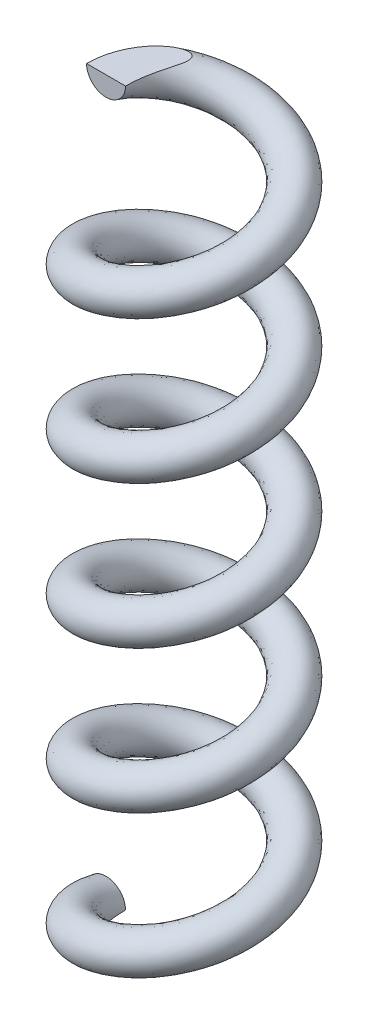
ISO-10303-21;
HEADER;
FILE_DESCRIPTION(('STEP AP214'),'2;1');
FILE_NAME('part.step','',(''),(''),'','','');
FILE_SCHEMA(('AUTOMOTIVE_DESIGN { 1 0 10303 214 1 1 1 1 }'));
ENDSEC;
DATA;
#1=APPLICATION_CONTEXT('core data for automotive mechanical design processes');
#2=APPLICATION_PROTOCOL_DEFINITION('international standard','automotive_design',2000,#1);
#3=PRODUCT_CONTEXT('',#1,'mechanical');
#4=PRODUCT('Part','Part','',(#3));
#5=PRODUCT_RELATED_PRODUCT_CATEGORY('part','',(#4));
#6=PRODUCT_DEFINITION_FORMATION('','',#4);
#7=PRODUCT_DEFINITION_CONTEXT('part definition',#1,'design');
#8=PRODUCT_DEFINITION('design','',#6,#7);
#9=PRODUCT_DEFINITION_SHAPE('','',#8);
#10=(LENGTH_UNIT() NAMED_UNIT(*) SI_UNIT(.MILLI.,.METRE.));
#11=(NAMED_UNIT(*) PLANE_ANGLE_UNIT() SI_UNIT($,.RADIAN.));
#12=(NAMED_UNIT(*) SI_UNIT($,.STERADIAN.) SOLID_ANGLE_UNIT());
#13=UNCERTAINTY_MEASURE_WITH_UNIT(LENGTH_MEASURE(1.E-05),#10,'distance_accuracy_value','');
#14=(GEOMETRIC_REPRESENTATION_CONTEXT(3) GLOBAL_UNCERTAINTY_ASSIGNED_CONTEXT((#13)) GLOBAL_UNIT_ASSIGNED_CONTEXT((#10,
#11,#12)) REPRESENTATION_CONTEXT('',''));
#15=CARTESIAN_POINT('',(0.,0.,0.));
#16=DIRECTION('',(0.,0.,1.));
#17=DIRECTION('',(1.,0.,0.));
#18=AXIS2_PLACEMENT_3D('',#15,#16,#17);
#19=CARTESIAN_POINT('',(-38.,56.6221098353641,9.77614774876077E-13));
#20=DIRECTION('',(0.,0.,1.));
#21=DIRECTION('',(1.,0.,0.));
#22=AXIS2_PLACEMENT_3D('',#19,#20,#21);
#23=PLANE('',#22);
#24=CARTESIAN_POINT('',(-38.,56.6221098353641,9.77614774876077E-13));
#25=DIRECTION('',(0.,0.,1.));
#26=DIRECTION('',(1.,0.,0.));
#27=AXIS2_PLACEMENT_3D('',#24,#25,#26);
#28=CIRCLE('',#27,3.5);
#29=CARTESIAN_POINT('',(-41.5,56.6221098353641,0.));
#30=VERTEX_POINT('',#29);
#31=CARTESIAN_POINT('',(-34.5,56.6221098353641,7.33211081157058E-13));
#32=VERTEX_POINT('',#31);
#33=EDGE_CURVE('E71',#30,#32,#28,.T.);
#34=ORIENTED_EDGE('',*,*,#33,.T.);
#35=DIRECTION('',(-1.,0.,0.));
#36=VECTOR('',#35,1.);
#37=CARTESIAN_POINT('',(-38.,56.6221098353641,9.77614774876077E-13));
#38=LINE('',#37,#36);
#39=EDGE_CURVE('E63',#32,#30,#38,.T.);
#40=ORIENTED_EDGE('',*,*,#39,.T.);
#41=EDGE_LOOP('',(#34,#40));
#42=FACE_BOUND('',#41,.T.);
#43=ADVANCED_FACE('F41',(#42),#23,.T.);
#44=CARTESIAN_POINT('',(-34.5,-71.5,0.));
#45=CARTESIAN_POINT('',(-34.5,-70.2187789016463,3.41165681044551));
#46=CARTESIAN_POINT('',(-32.4946784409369,-68.9375578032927,6.17174514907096));
#47=CARTESIAN_POINT('',(-30.4893568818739,-67.6563367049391,8.93183348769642));
#48=CARTESIAN_POINT('',(-27.2446784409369,-66.3751156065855,9.98609342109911));
#49=CARTESIAN_POINT('',(-24.,-65.0938945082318,11.0403533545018));
#50=CARTESIAN_POINT('',(-20.7553215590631,-63.8126734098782,9.98609342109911));
#51=CARTESIAN_POINT('',(-17.5106431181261,-62.5314523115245,8.93183348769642));
#52=CARTESIAN_POINT('',(-15.5053215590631,-61.2502312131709,6.17174514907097));
#53=CARTESIAN_POINT('',(-13.5,-59.9690101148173,3.41165681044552));
#54=CARTESIAN_POINT('',(-13.5,-58.6877890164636,0.));
#55=CARTESIAN_POINT('',(-13.5,-57.40656791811,-3.41165681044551));
#56=CARTESIAN_POINT('',(-15.5053215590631,-56.1253468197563,-6.17174514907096));
#57=CARTESIAN_POINT('',(-17.5106431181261,-54.8441257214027,-8.93183348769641));
#58=CARTESIAN_POINT('',(-20.7553215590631,-53.5629046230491,-9.98609342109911));
#59=CARTESIAN_POINT('',(-24.,-52.2816835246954,-11.0403533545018));
#60=CARTESIAN_POINT('',(-27.2446784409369,-51.0004624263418,-9.98609342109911));
#61=CARTESIAN_POINT('',(-30.4893568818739,-49.7192413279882,-8.93183348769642));
#62=CARTESIAN_POINT('',(-32.4946784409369,-48.4380202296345,-6.17174514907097));
#63=CARTESIAN_POINT('',(-34.5,-47.1567991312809,-3.41165681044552));
#64=CARTESIAN_POINT('',(-34.5,-45.8755780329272,0.));
#65=CARTESIAN_POINT('',(-34.5,-44.5943569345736,3.41165681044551));
#66=CARTESIAN_POINT('',(-32.4946784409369,-43.31313583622,6.17174514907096));
#67=CARTESIAN_POINT('',(-30.4893568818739,-42.0319147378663,8.93183348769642));
#68=CARTESIAN_POINT('',(-27.2446784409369,-40.7506936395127,9.98609342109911));
#69=CARTESIAN_POINT('',(-24.,-39.469472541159,11.0403533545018));
#70=CARTESIAN_POINT('',(-20.7553215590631,-38.1882514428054,9.98609342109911));
#71=CARTESIAN_POINT('',(-17.5106431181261,-36.9070303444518,8.93183348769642));
#72=CARTESIAN_POINT('',(-15.5053215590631,-35.6258092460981,6.17174514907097));
#73=CARTESIAN_POINT('',(-13.5,-34.3445881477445,3.41165681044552));
#74=CARTESIAN_POINT('',(-13.5,-33.0633670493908,0.));
#75=CARTESIAN_POINT('',(-13.5,-31.7821459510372,-3.41165681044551));
#76=CARTESIAN_POINT('',(-15.5053215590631,-30.5009248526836,-6.17174514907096));
#77=CARTESIAN_POINT('',(-17.5106431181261,-29.2197037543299,-8.93183348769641));
#78=CARTESIAN_POINT('',(-20.7553215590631,-27.9384826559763,-9.98609342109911));
#79=CARTESIAN_POINT('',(-24.,-26.6572615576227,-11.0403533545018));
#80=CARTESIAN_POINT('',(-27.2446784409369,-25.376040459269,-9.98609342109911));
#81=CARTESIAN_POINT('',(-30.4893568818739,-24.0948193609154,-8.93183348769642));
#82=CARTESIAN_POINT('',(-32.4946784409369,-22.8135982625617,-6.17174514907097));
#83=CARTESIAN_POINT('',(-34.5,-21.5323771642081,-3.41165681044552));
#84=CARTESIAN_POINT('',(-34.5,-20.2511560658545,0.));
#85=CARTESIAN_POINT('',(-34.5,-18.9699349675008,3.41165681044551));
#86=CARTESIAN_POINT('',(-32.4946784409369,-17.6887138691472,6.17174514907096));
#87=CARTESIAN_POINT('',(-30.4893568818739,-16.4074927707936,8.93183348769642));
#88=CARTESIAN_POINT('',(-27.2446784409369,-15.1262716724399,9.98609342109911));
#89=CARTESIAN_POINT('',(-24.,-13.8450505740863,11.0403533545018));
#90=CARTESIAN_POINT('',(-20.7553215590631,-12.5638294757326,9.98609342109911));
#91=CARTESIAN_POINT('',(-17.5106431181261,-11.282608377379,8.93183348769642));
#92=CARTESIAN_POINT('',(-15.5053215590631,-10.0013872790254,6.17174514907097));
#93=CARTESIAN_POINT('',(-13.5,-8.72016618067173,3.41165681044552));
#94=CARTESIAN_POINT('',(-13.5,-7.43894508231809,0.));
#95=CARTESIAN_POINT('',(-13.5,-6.15772398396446,-3.41165681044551));
#96=CARTESIAN_POINT('',(-15.5053215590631,-4.87650288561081,-6.17174514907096));
#97=CARTESIAN_POINT('',(-17.5106431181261,-3.59528178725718,-8.93183348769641));
#98=CARTESIAN_POINT('',(-20.7553215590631,-2.31406068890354,-9.98609342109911));
#99=CARTESIAN_POINT('',(-24.,-1.03283959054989,-11.0403533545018));
#100=CARTESIAN_POINT('',(-27.2446784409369,0.248381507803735,-9.98609342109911));
#101=CARTESIAN_POINT('',(-30.4893568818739,1.52960260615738,-8.93183348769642));
#102=CARTESIAN_POINT('',(-32.4946784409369,2.81082370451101,-6.17174514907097));
#103=CARTESIAN_POINT('',(-34.5,4.09204480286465,-3.41165681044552));
#104=CARTESIAN_POINT('',(-34.5,5.3732659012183,0.));
#105=CARTESIAN_POINT('',(-34.5,6.65448699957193,3.41165681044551));
#106=CARTESIAN_POINT('',(-32.4946784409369,7.93570809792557,6.17174514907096));
#107=CARTESIAN_POINT('',(-30.4893568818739,9.2169291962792,8.93183348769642));
#108=CARTESIAN_POINT('',(-27.2446784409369,10.4981502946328,9.98609342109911));
#109=CARTESIAN_POINT('',(-24.,11.7793713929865,11.0403533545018));
#110=CARTESIAN_POINT('',(-20.7553215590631,13.0605924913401,9.98609342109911));
#111=CARTESIAN_POINT('',(-17.5106431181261,14.3418135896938,8.93183348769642));
#112=CARTESIAN_POINT('',(-15.5053215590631,15.6230346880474,6.17174514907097));
#113=CARTESIAN_POINT('',(-13.5,16.904255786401,3.41165681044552));
#114=CARTESIAN_POINT('',(-13.5,18.1854768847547,0.));
#115=CARTESIAN_POINT('',(-13.5,19.4666979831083,-3.41165681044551));
#116=CARTESIAN_POINT('',(-15.5053215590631,20.747919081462,-6.17174514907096));
#117=CARTESIAN_POINT('',(-17.5106431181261,22.0291401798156,-8.93183348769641));
#118=CARTESIAN_POINT('',(-20.7553215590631,23.3103612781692,-9.98609342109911));
#119=CARTESIAN_POINT('',(-24.,24.5915823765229,-11.0403533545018));
#120=CARTESIAN_POINT('',(-27.2446784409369,25.8728034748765,-9.98609342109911));
#121=CARTESIAN_POINT('',(-30.4893568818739,27.1540245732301,-8.93183348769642));
#122=CARTESIAN_POINT('',(-32.4946784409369,28.4352456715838,-6.17174514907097));
#123=CARTESIAN_POINT('',(-34.5,29.7164667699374,-3.41165681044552));
#124=CARTESIAN_POINT('',(-34.5,30.9976878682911,0.));
#125=CARTESIAN_POINT('',(-34.5,32.2789089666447,3.41165681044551));
#126=CARTESIAN_POINT('',(-32.4946784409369,33.5601300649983,6.17174514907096));
#127=CARTESIAN_POINT('',(-30.4893568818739,34.841351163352,8.93183348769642));
#128=CARTESIAN_POINT('',(-27.2446784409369,36.1225722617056,9.98609342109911));
#129=CARTESIAN_POINT('',(-24.,37.4037933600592,11.0403533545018));
#130=CARTESIAN_POINT('',(-20.7553215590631,38.6850144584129,9.98609342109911));
#131=CARTESIAN_POINT('',(-17.5106431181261,39.9662355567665,8.93183348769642));
#132=CARTESIAN_POINT('',(-15.5053215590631,41.2474566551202,6.17174514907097));
#133=CARTESIAN_POINT('',(-13.5,42.5286777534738,3.41165681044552));
#134=CARTESIAN_POINT('',(-13.5,43.8098988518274,0.));
#135=CARTESIAN_POINT('',(-13.5,45.0911199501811,-3.41165681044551));
#136=CARTESIAN_POINT('',(-15.5053215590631,46.3723410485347,-6.17174514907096));
#137=CARTESIAN_POINT('',(-17.5106431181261,47.6535621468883,-8.93183348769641));
#138=CARTESIAN_POINT('',(-20.7553215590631,48.934783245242,-9.98609342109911));
#139=CARTESIAN_POINT('',(-24.,50.2160043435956,-11.0403533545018));
#140=CARTESIAN_POINT('',(-27.2446784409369,51.4972254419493,-9.98609342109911));
#141=CARTESIAN_POINT('',(-30.4893568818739,52.7784465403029,-8.93183348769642));
#142=CARTESIAN_POINT('',(-32.4946784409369,54.0596676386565,-6.17174514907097));
#143=CARTESIAN_POINT('',(-34.5,55.3408887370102,-3.41165681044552));
#144=CARTESIAN_POINT('',(-34.5,56.6221098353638,0.));
#145=CARTESIAN_POINT('',(-34.5,-64.5,0.));
#146=CARTESIAN_POINT('',(-34.5,-63.2187789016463,3.41165681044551));
#147=CARTESIAN_POINT('',(-32.4946784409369,-61.9375578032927,6.17174514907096));
#148=CARTESIAN_POINT('',(-30.4893568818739,-60.6563367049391,8.93183348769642));
#149=CARTESIAN_POINT('',(-27.2446784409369,-59.3751156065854,9.98609342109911));
#150=CARTESIAN_POINT('',(-24.,-58.0938945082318,11.0403533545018));
#151=CARTESIAN_POINT('',(-20.7553215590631,-56.8126734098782,9.98609342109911));
#152=CARTESIAN_POINT('',(-17.5106431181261,-55.5314523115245,8.93183348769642));
#153=CARTESIAN_POINT('',(-15.5053215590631,-54.2502312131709,6.17174514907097));
#154=CARTESIAN_POINT('',(-13.5,-52.9690101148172,3.41165681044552));
#155=CARTESIAN_POINT('',(-13.5,-51.6877890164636,0.));
#156=CARTESIAN_POINT('',(-13.5,-50.40656791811,-3.41165681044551));
#157=CARTESIAN_POINT('',(-15.5053215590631,-49.1253468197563,-6.17174514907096));
#158=CARTESIAN_POINT('',(-17.5106431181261,-47.8441257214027,-8.93183348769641));
#159=CARTESIAN_POINT('',(-20.7553215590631,-46.5629046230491,-9.98609342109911));
#160=CARTESIAN_POINT('',(-24.,-45.2816835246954,-11.0403533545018));
#161=CARTESIAN_POINT('',(-27.2446784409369,-44.0004624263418,-9.98609342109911));
#162=CARTESIAN_POINT('',(-30.4893568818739,-42.7192413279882,-8.93183348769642));
#163=CARTESIAN_POINT('',(-32.4946784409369,-41.4380202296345,-6.17174514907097));
#164=CARTESIAN_POINT('',(-34.5,-40.1567991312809,-3.41165681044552));
#165=CARTESIAN_POINT('',(-34.5,-38.8755780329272,0.));
#166=CARTESIAN_POINT('',(-34.5,-37.5943569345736,3.41165681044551));
#167=CARTESIAN_POINT('',(-32.4946784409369,-36.3131358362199,6.17174514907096));
#168=CARTESIAN_POINT('',(-30.4893568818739,-35.0319147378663,8.93183348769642));
#169=CARTESIAN_POINT('',(-27.2446784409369,-33.7506936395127,9.98609342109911));
#170=CARTESIAN_POINT('',(-24.,-32.469472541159,11.0403533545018));
#171=CARTESIAN_POINT('',(-20.7553215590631,-31.1882514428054,9.98609342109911));
#172=CARTESIAN_POINT('',(-17.5106431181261,-29.9070303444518,8.93183348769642));
#173=CARTESIAN_POINT('',(-15.5053215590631,-28.6258092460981,6.17174514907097));
#174=CARTESIAN_POINT('',(-13.5,-27.3445881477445,3.41165681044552));
#175=CARTESIAN_POINT('',(-13.5,-26.0633670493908,0.));
#176=CARTESIAN_POINT('',(-13.5,-24.7821459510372,-3.41165681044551));
#177=CARTESIAN_POINT('',(-15.5053215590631,-23.5009248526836,-6.17174514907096));
#178=CARTESIAN_POINT('',(-17.5106431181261,-22.2197037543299,-8.93183348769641));
#179=CARTESIAN_POINT('',(-20.7553215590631,-20.9384826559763,-9.98609342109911));
#180=CARTESIAN_POINT('',(-24.,-19.6572615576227,-11.0403533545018));
#181=CARTESIAN_POINT('',(-27.2446784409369,-18.376040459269,-9.98609342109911));
#182=CARTESIAN_POINT('',(-30.4893568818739,-17.0948193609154,-8.93183348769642));
#183=CARTESIAN_POINT('',(-32.4946784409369,-15.8135982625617,-6.17174514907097));
#184=CARTESIAN_POINT('',(-34.5,-14.5323771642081,-3.41165681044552));
#185=CARTESIAN_POINT('',(-34.5,-13.2511560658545,0.));
#186=CARTESIAN_POINT('',(-34.5,-11.9699349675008,3.41165681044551));
#187=CARTESIAN_POINT('',(-32.4946784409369,-10.6887138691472,6.17174514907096));
#188=CARTESIAN_POINT('',(-30.4893568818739,-9.40749277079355,8.93183348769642));
#189=CARTESIAN_POINT('',(-27.2446784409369,-8.12627167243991,9.98609342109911));
#190=CARTESIAN_POINT('',(-24.,-6.84505057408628,11.0403533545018));
#191=CARTESIAN_POINT('',(-20.7553215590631,-5.56382947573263,9.98609342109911));
#192=CARTESIAN_POINT('',(-17.5106431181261,-4.282608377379,8.93183348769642));
#193=CARTESIAN_POINT('',(-15.5053215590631,-3.00138727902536,6.17174514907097));
#194=CARTESIAN_POINT('',(-13.5,-1.72016618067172,3.41165681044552));
#195=CARTESIAN_POINT('',(-13.5,-0.438945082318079,0.));
#196=CARTESIAN_POINT('',(-13.5,0.842276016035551,-3.41165681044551));
#197=CARTESIAN_POINT('',(-15.5053215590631,2.12349711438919,-6.17174514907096));
#198=CARTESIAN_POINT('',(-17.5106431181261,3.40471821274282,-8.93183348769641));
#199=CARTESIAN_POINT('',(-20.7553215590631,4.68593931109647,-9.98609342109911));
#200=CARTESIAN_POINT('',(-24.,5.96716040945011,-11.0403533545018));
#201=CARTESIAN_POINT('',(-27.2446784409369,7.24838150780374,-9.98609342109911));
#202=CARTESIAN_POINT('',(-30.4893568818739,8.52960260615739,-8.93183348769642));
#203=CARTESIAN_POINT('',(-32.4946784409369,9.81082370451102,-6.17174514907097));
#204=CARTESIAN_POINT('',(-34.5,11.0920448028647,-3.41165681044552));
#205=CARTESIAN_POINT('',(-34.5,12.3732659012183,0.));
#206=CARTESIAN_POINT('',(-34.5,13.6544869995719,3.41165681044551));
#207=CARTESIAN_POINT('',(-32.4946784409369,14.9357080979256,6.17174514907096));
#208=CARTESIAN_POINT('',(-30.4893568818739,16.2169291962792,8.93183348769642));
#209=CARTESIAN_POINT('',(-27.2446784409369,17.4981502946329,9.98609342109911));
#210=CARTESIAN_POINT('',(-24.,18.7793713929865,11.0403533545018));
#211=CARTESIAN_POINT('',(-20.7553215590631,20.0605924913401,9.98609342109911));
#212=CARTESIAN_POINT('',(-17.5106431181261,21.3418135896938,8.93183348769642));
#213=CARTESIAN_POINT('',(-15.5053215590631,22.6230346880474,6.17174514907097));
#214=CARTESIAN_POINT('',(-13.5,23.904255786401,3.41165681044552));
#215=CARTESIAN_POINT('',(-13.5,25.1854768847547,0.));
#216=CARTESIAN_POINT('',(-13.5,26.4666979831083,-3.41165681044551));
#217=CARTESIAN_POINT('',(-15.5053215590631,27.747919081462,-6.17174514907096));
#218=CARTESIAN_POINT('',(-17.5106431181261,29.0291401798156,-8.93183348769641));
#219=CARTESIAN_POINT('',(-20.7553215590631,30.3103612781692,-9.98609342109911));
#220=CARTESIAN_POINT('',(-24.,31.5915823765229,-11.0403533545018));
#221=CARTESIAN_POINT('',(-27.2446784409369,32.8728034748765,-9.98609342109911));
#222=CARTESIAN_POINT('',(-30.4893568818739,34.1540245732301,-8.93183348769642));
#223=CARTESIAN_POINT('',(-32.4946784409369,35.4352456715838,-6.17174514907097));
#224=CARTESIAN_POINT('',(-34.5,36.7164667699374,-3.41165681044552));
#225=CARTESIAN_POINT('',(-34.5,37.9976878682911,0.));
#226=CARTESIAN_POINT('',(-34.5,39.2789089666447,3.41165681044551));
#227=CARTESIAN_POINT('',(-32.4946784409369,40.5601300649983,6.17174514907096));
#228=CARTESIAN_POINT('',(-30.4893568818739,41.841351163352,8.93183348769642));
#229=CARTESIAN_POINT('',(-27.2446784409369,43.1225722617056,9.98609342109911));
#230=CARTESIAN_POINT('',(-24.,44.4037933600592,11.0403533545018));
#231=CARTESIAN_POINT('',(-20.7553215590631,45.6850144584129,9.98609342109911));
#232=CARTESIAN_POINT('',(-17.5106431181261,46.9662355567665,8.93183348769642));
#233=CARTESIAN_POINT('',(-15.5053215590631,48.2474566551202,6.17174514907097));
#234=CARTESIAN_POINT('',(-13.5,49.5286777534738,3.41165681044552));
#235=CARTESIAN_POINT('',(-13.5,50.8098988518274,0.));
#236=CARTESIAN_POINT('',(-13.5,52.0911199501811,-3.41165681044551));
#237=CARTESIAN_POINT('',(-15.5053215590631,53.3723410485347,-6.17174514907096));
#238=CARTESIAN_POINT('',(-17.5106431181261,54.6535621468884,-8.93183348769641));
#239=CARTESIAN_POINT('',(-20.7553215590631,55.934783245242,-9.98609342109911));
#240=CARTESIAN_POINT('',(-24.,57.2160043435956,-11.0403533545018));
#241=CARTESIAN_POINT('',(-27.2446784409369,58.4972254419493,-9.98609342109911));
#242=CARTESIAN_POINT('',(-30.4893568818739,59.7784465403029,-8.93183348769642));
#243=CARTESIAN_POINT('',(-32.4946784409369,61.0596676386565,-6.17174514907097));
#244=CARTESIAN_POINT('',(-34.5,62.3408887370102,-3.41165681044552));
#245=CARTESIAN_POINT('',(-34.5,63.6221098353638,0.));
#246=CARTESIAN_POINT('',(-41.5,-64.5,0.));
#247=CARTESIAN_POINT('',(-41.5,-63.2187789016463,5.68609468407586));
#248=CARTESIAN_POINT('',(-38.1577974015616,-61.9375578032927,10.2862419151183));
#249=CARTESIAN_POINT('',(-34.8155948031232,-60.6563367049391,14.8863891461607));
#250=CARTESIAN_POINT('',(-29.4077974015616,-59.3751156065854,16.6434890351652));
#251=CARTESIAN_POINT('',(-24.,-58.0938945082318,18.4005889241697));
#252=CARTESIAN_POINT('',(-18.5922025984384,-56.8126734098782,16.6434890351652));
#253=CARTESIAN_POINT('',(-13.1844051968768,-55.5314523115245,14.8863891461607));
#254=CARTESIAN_POINT('',(-9.84220259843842,-54.2502312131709,10.2862419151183));
#255=CARTESIAN_POINT('',(-6.5,-52.9690101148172,5.68609468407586));
#256=CARTESIAN_POINT('',(-6.5,-51.6877890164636,0.));
#257=CARTESIAN_POINT('',(-6.5,-50.40656791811,-5.68609468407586));
#258=CARTESIAN_POINT('',(-9.84220259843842,-49.1253468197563,-10.2862419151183));
#259=CARTESIAN_POINT('',(-13.1844051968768,-47.8441257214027,-14.8863891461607));
#260=CARTESIAN_POINT('',(-18.5922025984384,-46.5629046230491,-16.6434890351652));
#261=CARTESIAN_POINT('',(-24.,-45.2816835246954,-18.4005889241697));
#262=CARTESIAN_POINT('',(-29.4077974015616,-44.0004624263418,-16.6434890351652));
#263=CARTESIAN_POINT('',(-34.8155948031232,-42.7192413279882,-14.8863891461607));
#264=CARTESIAN_POINT('',(-38.1577974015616,-41.4380202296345,-10.2862419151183));
#265=CARTESIAN_POINT('',(-41.5,-40.1567991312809,-5.68609468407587));
#266=CARTESIAN_POINT('',(-41.5,-38.8755780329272,0.));
#267=CARTESIAN_POINT('',(-41.5,-37.5943569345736,5.68609468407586));
#268=CARTESIAN_POINT('',(-38.1577974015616,-36.3131358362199,10.2862419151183));
#269=CARTESIAN_POINT('',(-34.8155948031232,-35.0319147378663,14.8863891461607));
#270=CARTESIAN_POINT('',(-29.4077974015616,-33.7506936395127,16.6434890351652));
#271=CARTESIAN_POINT('',(-24.,-32.469472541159,18.4005889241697));
#272=CARTESIAN_POINT('',(-18.5922025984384,-31.1882514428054,16.6434890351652));
#273=CARTESIAN_POINT('',(-13.1844051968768,-29.9070303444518,14.8863891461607));
#274=CARTESIAN_POINT('',(-9.84220259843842,-28.6258092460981,10.2862419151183));
#275=CARTESIAN_POINT('',(-6.5,-27.3445881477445,5.68609468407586));
#276=CARTESIAN_POINT('',(-6.5,-26.0633670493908,0.));
#277=CARTESIAN_POINT('',(-6.5,-24.7821459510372,-5.68609468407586));
#278=CARTESIAN_POINT('',(-9.84220259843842,-23.5009248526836,-10.2862419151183));
#279=CARTESIAN_POINT('',(-13.1844051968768,-22.2197037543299,-14.8863891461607));
#280=CARTESIAN_POINT('',(-18.5922025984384,-20.9384826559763,-16.6434890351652));
#281=CARTESIAN_POINT('',(-24.,-19.6572615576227,-18.4005889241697));
#282=CARTESIAN_POINT('',(-29.4077974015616,-18.376040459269,-16.6434890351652));
#283=CARTESIAN_POINT('',(-34.8155948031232,-17.0948193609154,-14.8863891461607));
#284=CARTESIAN_POINT('',(-38.1577974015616,-15.8135982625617,-10.2862419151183));
#285=CARTESIAN_POINT('',(-41.5,-14.5323771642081,-5.68609468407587));
#286=CARTESIAN_POINT('',(-41.5,-13.2511560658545,0.));
#287=CARTESIAN_POINT('',(-41.5,-11.9699349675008,5.68609468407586));
#288=CARTESIAN_POINT('',(-38.1577974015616,-10.6887138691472,10.2862419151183));
#289=CARTESIAN_POINT('',(-34.8155948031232,-9.40749277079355,14.8863891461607));
#290=CARTESIAN_POINT('',(-29.4077974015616,-8.12627167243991,16.6434890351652));
#291=CARTESIAN_POINT('',(-24.,-6.84505057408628,18.4005889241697));
#292=CARTESIAN_POINT('',(-18.5922025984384,-5.56382947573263,16.6434890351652));
#293=CARTESIAN_POINT('',(-13.1844051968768,-4.282608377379,14.8863891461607));
#294=CARTESIAN_POINT('',(-9.84220259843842,-3.00138727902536,10.2862419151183));
#295=CARTESIAN_POINT('',(-6.5,-1.72016618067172,5.68609468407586));
#296=CARTESIAN_POINT('',(-6.5,-0.438945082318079,0.));
#297=CARTESIAN_POINT('',(-6.5,0.842276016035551,-5.68609468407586));
#298=CARTESIAN_POINT('',(-9.84220259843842,2.12349711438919,-10.2862419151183));
#299=CARTESIAN_POINT('',(-13.1844051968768,3.40471821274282,-14.8863891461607));
#300=CARTESIAN_POINT('',(-18.5922025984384,4.68593931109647,-16.6434890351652));
#301=CARTESIAN_POINT('',(-24.,5.96716040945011,-18.4005889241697));
#302=CARTESIAN_POINT('',(-29.4077974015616,7.24838150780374,-16.6434890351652));
#303=CARTESIAN_POINT('',(-34.8155948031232,8.52960260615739,-14.8863891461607));
#304=CARTESIAN_POINT('',(-38.1577974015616,9.81082370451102,-10.2862419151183));
#305=CARTESIAN_POINT('',(-41.5,11.0920448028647,-5.68609468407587));
#306=CARTESIAN_POINT('',(-41.5,12.3732659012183,0.));
#307=CARTESIAN_POINT('',(-41.5,13.6544869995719,5.68609468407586));
#308=CARTESIAN_POINT('',(-38.1577974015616,14.9357080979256,10.2862419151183));
#309=CARTESIAN_POINT('',(-34.8155948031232,16.2169291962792,14.8863891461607));
#310=CARTESIAN_POINT('',(-29.4077974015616,17.4981502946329,16.6434890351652));
#311=CARTESIAN_POINT('',(-24.,18.7793713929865,18.4005889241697));
#312=CARTESIAN_POINT('',(-18.5922025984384,20.0605924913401,16.6434890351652));
#313=CARTESIAN_POINT('',(-13.1844051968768,21.3418135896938,14.8863891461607));
#314=CARTESIAN_POINT('',(-9.84220259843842,22.6230346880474,10.2862419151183));
#315=CARTESIAN_POINT('',(-6.5,23.904255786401,5.68609468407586));
#316=CARTESIAN_POINT('',(-6.5,25.1854768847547,0.));
#317=CARTESIAN_POINT('',(-6.5,26.4666979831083,-5.68609468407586));
#318=CARTESIAN_POINT('',(-9.84220259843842,27.747919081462,-10.2862419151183));
#319=CARTESIAN_POINT('',(-13.1844051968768,29.0291401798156,-14.8863891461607));
#320=CARTESIAN_POINT('',(-18.5922025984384,30.3103612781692,-16.6434890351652));
#321=CARTESIAN_POINT('',(-24.,31.5915823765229,-18.4005889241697));
#322=CARTESIAN_POINT('',(-29.4077974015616,32.8728034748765,-16.6434890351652));
#323=CARTESIAN_POINT('',(-34.8155948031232,34.1540245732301,-14.8863891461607));
#324=CARTESIAN_POINT('',(-38.1577974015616,35.4352456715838,-10.2862419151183));
#325=CARTESIAN_POINT('',(-41.5,36.7164667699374,-5.68609468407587));
#326=CARTESIAN_POINT('',(-41.5,37.9976878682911,0.));
#327=CARTESIAN_POINT('',(-41.5,39.2789089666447,5.68609468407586));
#328=CARTESIAN_POINT('',(-38.1577974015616,40.5601300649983,10.2862419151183));
#329=CARTESIAN_POINT('',(-34.8155948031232,41.841351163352,14.8863891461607));
#330=CARTESIAN_POINT('',(-29.4077974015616,43.1225722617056,16.6434890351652));
#331=CARTESIAN_POINT('',(-24.,44.4037933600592,18.4005889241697));
#332=CARTESIAN_POINT('',(-18.5922025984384,45.6850144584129,16.6434890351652));
#333=CARTESIAN_POINT('',(-13.1844051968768,46.9662355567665,14.8863891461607));
#334=CARTESIAN_POINT('',(-9.84220259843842,48.2474566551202,10.2862419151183));
#335=CARTESIAN_POINT('',(-6.5,49.5286777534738,5.68609468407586));
#336=CARTESIAN_POINT('',(-6.5,50.8098988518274,0.));
#337=CARTESIAN_POINT('',(-6.5,52.0911199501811,-5.68609468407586));
#338=CARTESIAN_POINT('',(-9.84220259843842,53.3723410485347,-10.2862419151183));
#339=CARTESIAN_POINT('',(-13.1844051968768,54.6535621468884,-14.8863891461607));
#340=CARTESIAN_POINT('',(-18.5922025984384,55.934783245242,-16.6434890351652));
#341=CARTESIAN_POINT('',(-24.,57.2160043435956,-18.4005889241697));
#342=CARTESIAN_POINT('',(-29.4077974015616,58.4972254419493,-16.6434890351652));
#343=CARTESIAN_POINT('',(-34.8155948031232,59.7784465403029,-14.8863891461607));
#344=CARTESIAN_POINT('',(-38.1577974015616,61.0596676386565,-10.2862419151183));
#345=CARTESIAN_POINT('',(-41.5,62.3408887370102,-5.68609468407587));
#346=CARTESIAN_POINT('',(-41.5,63.6221098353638,0.));
#347=CARTESIAN_POINT('',(-41.5,-71.5,0.));
#348=CARTESIAN_POINT('',(-41.5,-70.2187789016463,5.68609468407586));
#349=CARTESIAN_POINT('',(-38.1577974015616,-68.9375578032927,10.2862419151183));
#350=CARTESIAN_POINT('',(-34.8155948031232,-67.6563367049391,14.8863891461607));
#351=CARTESIAN_POINT('',(-29.4077974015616,-66.3751156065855,16.6434890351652));
#352=CARTESIAN_POINT('',(-24.,-65.0938945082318,18.4005889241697));
#353=CARTESIAN_POINT('',(-18.5922025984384,-63.8126734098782,16.6434890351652));
#354=CARTESIAN_POINT('',(-13.1844051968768,-62.5314523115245,14.8863891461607));
#355=CARTESIAN_POINT('',(-9.84220259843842,-61.2502312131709,10.2862419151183));
#356=CARTESIAN_POINT('',(-6.5,-59.9690101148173,5.68609468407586));
#357=CARTESIAN_POINT('',(-6.5,-58.6877890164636,0.));
#358=CARTESIAN_POINT('',(-6.5,-57.40656791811,-5.68609468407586));
#359=CARTESIAN_POINT('',(-9.84220259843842,-56.1253468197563,-10.2862419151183));
#360=CARTESIAN_POINT('',(-13.1844051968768,-54.8441257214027,-14.8863891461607));
#361=CARTESIAN_POINT('',(-18.5922025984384,-53.5629046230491,-16.6434890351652));
#362=CARTESIAN_POINT('',(-24.,-52.2816835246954,-18.4005889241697));
#363=CARTESIAN_POINT('',(-29.4077974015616,-51.0004624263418,-16.6434890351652));
#364=CARTESIAN_POINT('',(-34.8155948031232,-49.7192413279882,-14.8863891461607));
#365=CARTESIAN_POINT('',(-38.1577974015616,-48.4380202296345,-10.2862419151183));
#366=CARTESIAN_POINT('',(-41.5,-47.1567991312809,-5.68609468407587));
#367=CARTESIAN_POINT('',(-41.5,-45.8755780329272,0.));
#368=CARTESIAN_POINT('',(-41.5,-44.5943569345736,5.68609468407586));
#369=CARTESIAN_POINT('',(-38.1577974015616,-43.31313583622,10.2862419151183));
#370=CARTESIAN_POINT('',(-34.8155948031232,-42.0319147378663,14.8863891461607));
#371=CARTESIAN_POINT('',(-29.4077974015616,-40.7506936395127,16.6434890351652));
#372=CARTESIAN_POINT('',(-24.,-39.469472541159,18.4005889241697));
#373=CARTESIAN_POINT('',(-18.5922025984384,-38.1882514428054,16.6434890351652));
#374=CARTESIAN_POINT('',(-13.1844051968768,-36.9070303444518,14.8863891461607));
#375=CARTESIAN_POINT('',(-9.84220259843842,-35.6258092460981,10.2862419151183));
#376=CARTESIAN_POINT('',(-6.5,-34.3445881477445,5.68609468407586));
#377=CARTESIAN_POINT('',(-6.5,-33.0633670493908,0.));
#378=CARTESIAN_POINT('',(-6.5,-31.7821459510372,-5.68609468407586));
#379=CARTESIAN_POINT('',(-9.84220259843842,-30.5009248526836,-10.2862419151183));
#380=CARTESIAN_POINT('',(-13.1844051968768,-29.2197037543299,-14.8863891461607));
#381=CARTESIAN_POINT('',(-18.5922025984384,-27.9384826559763,-16.6434890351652));
#382=CARTESIAN_POINT('',(-24.,-26.6572615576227,-18.4005889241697));
#383=CARTESIAN_POINT('',(-29.4077974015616,-25.376040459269,-16.6434890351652));
#384=CARTESIAN_POINT('',(-34.8155948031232,-24.0948193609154,-14.8863891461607));
#385=CARTESIAN_POINT('',(-38.1577974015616,-22.8135982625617,-10.2862419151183));
#386=CARTESIAN_POINT('',(-41.5,-21.5323771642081,-5.68609468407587));
#387=CARTESIAN_POINT('',(-41.5,-20.2511560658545,0.));
#388=CARTESIAN_POINT('',(-41.5,-18.9699349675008,5.68609468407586));
#389=CARTESIAN_POINT('',(-38.1577974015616,-17.6887138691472,10.2862419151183));
#390=CARTESIAN_POINT('',(-34.8155948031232,-16.4074927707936,14.8863891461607));
#391=CARTESIAN_POINT('',(-29.4077974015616,-15.1262716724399,16.6434890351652));
#392=CARTESIAN_POINT('',(-24.,-13.8450505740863,18.4005889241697));
#393=CARTESIAN_POINT('',(-18.5922025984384,-12.5638294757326,16.6434890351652));
#394=CARTESIAN_POINT('',(-13.1844051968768,-11.282608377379,14.8863891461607));
#395=CARTESIAN_POINT('',(-9.84220259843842,-10.0013872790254,10.2862419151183));
#396=CARTESIAN_POINT('',(-6.5,-8.72016618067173,5.68609468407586));
#397=CARTESIAN_POINT('',(-6.5,-7.43894508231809,0.));
#398=CARTESIAN_POINT('',(-6.5,-6.15772398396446,-5.68609468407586));
#399=CARTESIAN_POINT('',(-9.84220259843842,-4.87650288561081,-10.2862419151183));
#400=CARTESIAN_POINT('',(-13.1844051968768,-3.59528178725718,-14.8863891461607));
#401=CARTESIAN_POINT('',(-18.5922025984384,-2.31406068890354,-16.6434890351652));
#402=CARTESIAN_POINT('',(-24.,-1.03283959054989,-18.4005889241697));
#403=CARTESIAN_POINT('',(-29.4077974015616,0.248381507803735,-16.6434890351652));
#404=CARTESIAN_POINT('',(-34.8155948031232,1.52960260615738,-14.8863891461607));
#405=CARTESIAN_POINT('',(-38.1577974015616,2.81082370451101,-10.2862419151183));
#406=CARTESIAN_POINT('',(-41.5,4.09204480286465,-5.68609468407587));
#407=CARTESIAN_POINT('',(-41.5,5.3732659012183,0.));
#408=CARTESIAN_POINT('',(-41.5,6.65448699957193,5.68609468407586));
#409=CARTESIAN_POINT('',(-38.1577974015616,7.93570809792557,10.2862419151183));
#410=CARTESIAN_POINT('',(-34.8155948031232,9.2169291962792,14.8863891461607));
#411=CARTESIAN_POINT('',(-29.4077974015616,10.4981502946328,16.6434890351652));
#412=CARTESIAN_POINT('',(-24.,11.7793713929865,18.4005889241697));
#413=CARTESIAN_POINT('',(-18.5922025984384,13.0605924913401,16.6434890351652));
#414=CARTESIAN_POINT('',(-13.1844051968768,14.3418135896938,14.8863891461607));
#415=CARTESIAN_POINT('',(-9.84220259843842,15.6230346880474,10.2862419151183));
#416=CARTESIAN_POINT('',(-6.5,16.904255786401,5.68609468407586));
#417=CARTESIAN_POINT('',(-6.5,18.1854768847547,0.));
#418=CARTESIAN_POINT('',(-6.5,19.4666979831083,-5.68609468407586));
#419=CARTESIAN_POINT('',(-9.84220259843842,20.747919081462,-10.2862419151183));
#420=CARTESIAN_POINT('',(-13.1844051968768,22.0291401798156,-14.8863891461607));
#421=CARTESIAN_POINT('',(-18.5922025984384,23.3103612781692,-16.6434890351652));
#422=CARTESIAN_POINT('',(-24.,24.5915823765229,-18.4005889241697));
#423=CARTESIAN_POINT('',(-29.4077974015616,25.8728034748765,-16.6434890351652));
#424=CARTESIAN_POINT('',(-34.8155948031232,27.1540245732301,-14.8863891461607));
#425=CARTESIAN_POINT('',(-38.1577974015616,28.4352456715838,-10.2862419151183));
#426=CARTESIAN_POINT('',(-41.5,29.7164667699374,-5.68609468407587));
#427=CARTESIAN_POINT('',(-41.5,30.9976878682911,0.));
#428=CARTESIAN_POINT('',(-41.5,32.2789089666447,5.68609468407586));
#429=CARTESIAN_POINT('',(-38.1577974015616,33.5601300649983,10.2862419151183));
#430=CARTESIAN_POINT('',(-34.8155948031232,34.841351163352,14.8863891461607));
#431=CARTESIAN_POINT('',(-29.4077974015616,36.1225722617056,16.6434890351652));
#432=CARTESIAN_POINT('',(-24.,37.4037933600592,18.4005889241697));
#433=CARTESIAN_POINT('',(-18.5922025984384,38.6850144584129,16.6434890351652));
#434=CARTESIAN_POINT('',(-13.1844051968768,39.9662355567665,14.8863891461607));
#435=CARTESIAN_POINT('',(-9.84220259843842,41.2474566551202,10.2862419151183));
#436=CARTESIAN_POINT('',(-6.5,42.5286777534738,5.68609468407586));
#437=CARTESIAN_POINT('',(-6.5,43.8098988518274,0.));
#438=CARTESIAN_POINT('',(-6.5,45.0911199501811,-5.68609468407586));
#439=CARTESIAN_POINT('',(-9.84220259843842,46.3723410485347,-10.2862419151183));
#440=CARTESIAN_POINT('',(-13.1844051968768,47.6535621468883,-14.8863891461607));
#441=CARTESIAN_POINT('',(-18.5922025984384,48.934783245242,-16.6434890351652));
#442=CARTESIAN_POINT('',(-24.,50.2160043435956,-18.4005889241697));
#443=CARTESIAN_POINT('',(-29.4077974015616,51.4972254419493,-16.6434890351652));
#444=CARTESIAN_POINT('',(-34.8155948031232,52.7784465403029,-14.8863891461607));
#445=CARTESIAN_POINT('',(-38.1577974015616,54.0596676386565,-10.2862419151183));
#446=CARTESIAN_POINT('',(-41.5,55.3408887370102,-5.68609468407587));
#447=CARTESIAN_POINT('',(-41.5,56.6221098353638,0.));
#448=CARTESIAN_POINT('',(-41.5,-78.5,0.));
#449=CARTESIAN_POINT('',(-41.5,-77.2187789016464,5.68609468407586));
#450=CARTESIAN_POINT('',(-38.1577974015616,-75.9375578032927,10.2862419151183));
#451=CARTESIAN_POINT('',(-34.8155948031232,-74.6563367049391,14.8863891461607));
#452=CARTESIAN_POINT('',(-29.4077974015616,-73.3751156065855,16.6434890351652));
#453=CARTESIAN_POINT('',(-24.,-72.0938945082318,18.4005889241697));
#454=CARTESIAN_POINT('',(-18.5922025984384,-70.8126734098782,16.6434890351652));
#455=CARTESIAN_POINT('',(-13.1844051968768,-69.5314523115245,14.8863891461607));
#456=CARTESIAN_POINT('',(-9.84220259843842,-68.2502312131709,10.2862419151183));
#457=CARTESIAN_POINT('',(-6.5,-66.9690101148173,5.68609468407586));
#458=CARTESIAN_POINT('',(-6.5,-65.6877890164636,0.));
#459=CARTESIAN_POINT('',(-6.5,-64.40656791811,-5.68609468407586));
#460=CARTESIAN_POINT('',(-9.84220259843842,-63.1253468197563,-10.2862419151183));
#461=CARTESIAN_POINT('',(-13.1844051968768,-61.8441257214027,-14.8863891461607));
#462=CARTESIAN_POINT('',(-18.5922025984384,-60.5629046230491,-16.6434890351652));
#463=CARTESIAN_POINT('',(-24.,-59.2816835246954,-18.4005889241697));
#464=CARTESIAN_POINT('',(-29.4077974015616,-58.0004624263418,-16.6434890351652));
#465=CARTESIAN_POINT('',(-34.8155948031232,-56.7192413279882,-14.8863891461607));
#466=CARTESIAN_POINT('',(-38.1577974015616,-55.4380202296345,-10.2862419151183));
#467=CARTESIAN_POINT('',(-41.5,-54.1567991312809,-5.68609468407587));
#468=CARTESIAN_POINT('',(-41.5,-52.8755780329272,0.));
#469=CARTESIAN_POINT('',(-41.5,-51.5943569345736,5.68609468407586));
#470=CARTESIAN_POINT('',(-38.1577974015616,-50.31313583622,10.2862419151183));
#471=CARTESIAN_POINT('',(-34.8155948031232,-49.0319147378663,14.8863891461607));
#472=CARTESIAN_POINT('',(-29.4077974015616,-47.7506936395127,16.6434890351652));
#473=CARTESIAN_POINT('',(-24.,-46.469472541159,18.4005889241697));
#474=CARTESIAN_POINT('',(-18.5922025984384,-45.1882514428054,16.6434890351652));
#475=CARTESIAN_POINT('',(-13.1844051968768,-43.9070303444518,14.8863891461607));
#476=CARTESIAN_POINT('',(-9.84220259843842,-42.6258092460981,10.2862419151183));
#477=CARTESIAN_POINT('',(-6.5,-41.3445881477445,5.68609468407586));
#478=CARTESIAN_POINT('',(-6.5,-40.0633670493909,0.));
#479=CARTESIAN_POINT('',(-6.5,-38.7821459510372,-5.68609468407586));
#480=CARTESIAN_POINT('',(-9.84220259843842,-37.5009248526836,-10.2862419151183));
#481=CARTESIAN_POINT('',(-13.1844051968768,-36.2197037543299,-14.8863891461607));
#482=CARTESIAN_POINT('',(-18.5922025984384,-34.9384826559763,-16.6434890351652));
#483=CARTESIAN_POINT('',(-24.,-33.6572615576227,-18.4005889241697));
#484=CARTESIAN_POINT('',(-29.4077974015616,-32.376040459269,-16.6434890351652));
#485=CARTESIAN_POINT('',(-34.8155948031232,-31.0948193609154,-14.8863891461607));
#486=CARTESIAN_POINT('',(-38.1577974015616,-29.8135982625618,-10.2862419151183));
#487=CARTESIAN_POINT('',(-41.5,-28.5323771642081,-5.68609468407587));
#488=CARTESIAN_POINT('',(-41.5,-27.2511560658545,0.));
#489=CARTESIAN_POINT('',(-41.5,-25.9699349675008,5.68609468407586));
#490=CARTESIAN_POINT('',(-38.1577974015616,-24.6887138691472,10.2862419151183));
#491=CARTESIAN_POINT('',(-34.8155948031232,-23.4074927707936,14.8863891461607));
#492=CARTESIAN_POINT('',(-29.4077974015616,-22.1262716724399,16.6434890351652));
#493=CARTESIAN_POINT('',(-24.,-20.8450505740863,18.4005889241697));
#494=CARTESIAN_POINT('',(-18.5922025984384,-19.5638294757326,16.6434890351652));
#495=CARTESIAN_POINT('',(-13.1844051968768,-18.282608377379,14.8863891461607));
#496=CARTESIAN_POINT('',(-9.84220259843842,-17.0013872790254,10.2862419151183));
#497=CARTESIAN_POINT('',(-6.5,-15.7201661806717,5.68609468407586));
#498=CARTESIAN_POINT('',(-6.5,-14.4389450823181,0.));
#499=CARTESIAN_POINT('',(-6.5,-13.1577239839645,-5.68609468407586));
#500=CARTESIAN_POINT('',(-9.84220259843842,-11.8765028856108,-10.2862419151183));
#501=CARTESIAN_POINT('',(-13.1844051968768,-10.5952817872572,-14.8863891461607));
#502=CARTESIAN_POINT('',(-18.5922025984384,-9.31406068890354,-16.6434890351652));
#503=CARTESIAN_POINT('',(-24.,-8.0328395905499,-18.4005889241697));
#504=CARTESIAN_POINT('',(-29.4077974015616,-6.75161849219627,-16.6434890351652));
#505=CARTESIAN_POINT('',(-34.8155948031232,-5.47039739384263,-14.8863891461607));
#506=CARTESIAN_POINT('',(-38.1577974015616,-4.189176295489,-10.2862419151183));
#507=CARTESIAN_POINT('',(-41.5,-2.90795519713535,-5.68609468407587));
#508=CARTESIAN_POINT('',(-41.5,-1.62673409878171,0.));
#509=CARTESIAN_POINT('',(-41.5,-0.34551300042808,5.68609468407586));
#510=CARTESIAN_POINT('',(-38.1577974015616,0.935708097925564,10.2862419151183));
#511=CARTESIAN_POINT('',(-34.8155948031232,2.21692919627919,14.8863891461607));
#512=CARTESIAN_POINT('',(-29.4077974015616,3.49815029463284,16.6434890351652));
#513=CARTESIAN_POINT('',(-24.,4.77937139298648,18.4005889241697));
#514=CARTESIAN_POINT('',(-18.5922025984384,6.06059249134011,16.6434890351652));
#515=CARTESIAN_POINT('',(-13.1844051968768,7.34181358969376,14.8863891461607));
#516=CARTESIAN_POINT('',(-9.84220259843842,8.62303468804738,10.2862419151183));
#517=CARTESIAN_POINT('',(-6.5,9.90425578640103,5.68609468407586));
#518=CARTESIAN_POINT('',(-6.5,11.1854768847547,0.));
#519=CARTESIAN_POINT('',(-6.5,12.4666979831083,-5.68609468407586));
#520=CARTESIAN_POINT('',(-9.84220259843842,13.7479190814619,-10.2862419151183));
#521=CARTESIAN_POINT('',(-13.1844051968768,15.0291401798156,-14.8863891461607));
#522=CARTESIAN_POINT('',(-18.5922025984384,16.3103612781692,-16.6434890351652));
#523=CARTESIAN_POINT('',(-24.,17.5915823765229,-18.4005889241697));
#524=CARTESIAN_POINT('',(-29.4077974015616,18.8728034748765,-16.6434890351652));
#525=CARTESIAN_POINT('',(-34.8155948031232,20.1540245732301,-14.8863891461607));
#526=CARTESIAN_POINT('',(-38.1577974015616,21.4352456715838,-10.2862419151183));
#527=CARTESIAN_POINT('',(-41.5,22.7164667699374,-5.68609468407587));
#528=CARTESIAN_POINT('',(-41.5,23.9976878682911,0.));
#529=CARTESIAN_POINT('',(-41.5,25.2789089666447,5.68609468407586));
#530=CARTESIAN_POINT('',(-38.1577974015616,26.5601300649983,10.2862419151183));
#531=CARTESIAN_POINT('',(-34.8155948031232,27.841351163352,14.8863891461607));
#532=CARTESIAN_POINT('',(-29.4077974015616,29.1225722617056,16.6434890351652));
#533=CARTESIAN_POINT('',(-24.,30.4037933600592,18.4005889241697));
#534=CARTESIAN_POINT('',(-18.5922025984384,31.6850144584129,16.6434890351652));
#535=CARTESIAN_POINT('',(-13.1844051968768,32.9662355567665,14.8863891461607));
#536=CARTESIAN_POINT('',(-9.84220259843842,34.2474566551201,10.2862419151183));
#537=CARTESIAN_POINT('',(-6.5,35.5286777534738,5.68609468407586));
#538=CARTESIAN_POINT('',(-6.5,36.8098988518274,0.));
#539=CARTESIAN_POINT('',(-6.5,38.0911199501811,-5.68609468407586));
#540=CARTESIAN_POINT('',(-9.84220259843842,39.3723410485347,-10.2862419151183));
#541=CARTESIAN_POINT('',(-13.1844051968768,40.6535621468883,-14.8863891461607));
#542=CARTESIAN_POINT('',(-18.5922025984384,41.934783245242,-16.6434890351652));
#543=CARTESIAN_POINT('',(-24.,43.2160043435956,-18.4005889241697));
#544=CARTESIAN_POINT('',(-29.4077974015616,44.4972254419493,-16.6434890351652));
#545=CARTESIAN_POINT('',(-34.8155948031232,45.7784465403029,-14.8863891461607));
#546=CARTESIAN_POINT('',(-38.1577974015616,47.0596676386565,-10.2862419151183));
#547=CARTESIAN_POINT('',(-41.5,48.3408887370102,-5.68609468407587));
#548=CARTESIAN_POINT('',(-41.5,49.6221098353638,0.));
#549=CARTESIAN_POINT('',(-34.5,-78.5,0.));
#550=CARTESIAN_POINT('',(-34.5,-77.2187789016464,3.41165681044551));
#551=CARTESIAN_POINT('',(-32.4946784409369,-75.9375578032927,6.17174514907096));
#552=CARTESIAN_POINT('',(-30.4893568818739,-74.6563367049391,8.93183348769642));
#553=CARTESIAN_POINT('',(-27.2446784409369,-73.3751156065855,9.98609342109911));
#554=CARTESIAN_POINT('',(-24.,-72.0938945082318,11.0403533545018));
#555=CARTESIAN_POINT('',(-20.7553215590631,-70.8126734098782,9.98609342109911));
#556=CARTESIAN_POINT('',(-17.5106431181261,-69.5314523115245,8.93183348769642));
#557=CARTESIAN_POINT('',(-15.5053215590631,-68.2502312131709,6.17174514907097));
#558=CARTESIAN_POINT('',(-13.5,-66.9690101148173,3.41165681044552));
#559=CARTESIAN_POINT('',(-13.5,-65.6877890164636,0.));
#560=CARTESIAN_POINT('',(-13.5,-64.40656791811,-3.41165681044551));
#561=CARTESIAN_POINT('',(-15.5053215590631,-63.1253468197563,-6.17174514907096));
#562=CARTESIAN_POINT('',(-17.5106431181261,-61.8441257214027,-8.93183348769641));
#563=CARTESIAN_POINT('',(-20.7553215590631,-60.5629046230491,-9.98609342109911));
#564=CARTESIAN_POINT('',(-24.,-59.2816835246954,-11.0403533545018));
#565=CARTESIAN_POINT('',(-27.2446784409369,-58.0004624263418,-9.98609342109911));
#566=CARTESIAN_POINT('',(-30.4893568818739,-56.7192413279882,-8.93183348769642));
#567=CARTESIAN_POINT('',(-32.4946784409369,-55.4380202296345,-6.17174514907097));
#568=CARTESIAN_POINT('',(-34.5,-54.1567991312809,-3.41165681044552));
#569=CARTESIAN_POINT('',(-34.5,-52.8755780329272,0.));
#570=CARTESIAN_POINT('',(-34.5,-51.5943569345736,3.41165681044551));
#571=CARTESIAN_POINT('',(-32.4946784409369,-50.31313583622,6.17174514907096));
#572=CARTESIAN_POINT('',(-30.4893568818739,-49.0319147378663,8.93183348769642));
#573=CARTESIAN_POINT('',(-27.2446784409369,-47.7506936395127,9.98609342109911));
#574=CARTESIAN_POINT('',(-24.,-46.469472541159,11.0403533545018));
#575=CARTESIAN_POINT('',(-20.7553215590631,-45.1882514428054,9.98609342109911));
#576=CARTESIAN_POINT('',(-17.5106431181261,-43.9070303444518,8.93183348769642));
#577=CARTESIAN_POINT('',(-15.5053215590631,-42.6258092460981,6.17174514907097));
#578=CARTESIAN_POINT('',(-13.5,-41.3445881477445,3.41165681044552));
#579=CARTESIAN_POINT('',(-13.5,-40.0633670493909,0.));
#580=CARTESIAN_POINT('',(-13.5,-38.7821459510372,-3.41165681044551));
#581=CARTESIAN_POINT('',(-15.5053215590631,-37.5009248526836,-6.17174514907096));
#582=CARTESIAN_POINT('',(-17.5106431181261,-36.2197037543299,-8.93183348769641));
#583=CARTESIAN_POINT('',(-20.7553215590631,-34.9384826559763,-9.98609342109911));
#584=CARTESIAN_POINT('',(-24.,-33.6572615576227,-11.0403533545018));
#585=CARTESIAN_POINT('',(-27.2446784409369,-32.376040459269,-9.98609342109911));
#586=CARTESIAN_POINT('',(-30.4893568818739,-31.0948193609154,-8.93183348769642));
#587=CARTESIAN_POINT('',(-32.4946784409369,-29.8135982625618,-6.17174514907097));
#588=CARTESIAN_POINT('',(-34.5,-28.5323771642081,-3.41165681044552));
#589=CARTESIAN_POINT('',(-34.5,-27.2511560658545,0.));
#590=CARTESIAN_POINT('',(-34.5,-25.9699349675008,3.41165681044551));
#591=CARTESIAN_POINT('',(-32.4946784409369,-24.6887138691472,6.17174514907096));
#592=CARTESIAN_POINT('',(-30.4893568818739,-23.4074927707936,8.93183348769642));
#593=CARTESIAN_POINT('',(-27.2446784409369,-22.1262716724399,9.98609342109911));
#594=CARTESIAN_POINT('',(-24.,-20.8450505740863,11.0403533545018));
#595=CARTESIAN_POINT('',(-20.7553215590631,-19.5638294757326,9.98609342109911));
#596=CARTESIAN_POINT('',(-17.5106431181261,-18.282608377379,8.93183348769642));
#597=CARTESIAN_POINT('',(-15.5053215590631,-17.0013872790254,6.17174514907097));
#598=CARTESIAN_POINT('',(-13.5,-15.7201661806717,3.41165681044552));
#599=CARTESIAN_POINT('',(-13.5,-14.4389450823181,0.));
#600=CARTESIAN_POINT('',(-13.5,-13.1577239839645,-3.41165681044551));
#601=CARTESIAN_POINT('',(-15.5053215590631,-11.8765028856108,-6.17174514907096));
#602=CARTESIAN_POINT('',(-17.5106431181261,-10.5952817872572,-8.93183348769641));
#603=CARTESIAN_POINT('',(-20.7553215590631,-9.31406068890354,-9.98609342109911));
#604=CARTESIAN_POINT('',(-24.,-8.0328395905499,-11.0403533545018));
#605=CARTESIAN_POINT('',(-27.2446784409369,-6.75161849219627,-9.98609342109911));
#606=CARTESIAN_POINT('',(-30.4893568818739,-5.47039739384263,-8.93183348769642));
#607=CARTESIAN_POINT('',(-32.4946784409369,-4.189176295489,-6.17174514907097));
#608=CARTESIAN_POINT('',(-34.5,-2.90795519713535,-3.41165681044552));
#609=CARTESIAN_POINT('',(-34.5,-1.62673409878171,0.));
#610=CARTESIAN_POINT('',(-34.5,-0.34551300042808,3.41165681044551));
#611=CARTESIAN_POINT('',(-32.4946784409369,0.935708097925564,6.17174514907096));
#612=CARTESIAN_POINT('',(-30.4893568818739,2.21692919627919,8.93183348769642));
#613=CARTESIAN_POINT('',(-27.2446784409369,3.49815029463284,9.98609342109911));
#614=CARTESIAN_POINT('',(-24.,4.77937139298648,11.0403533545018));
#615=CARTESIAN_POINT('',(-20.7553215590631,6.06059249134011,9.98609342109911));
#616=CARTESIAN_POINT('',(-17.5106431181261,7.34181358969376,8.93183348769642));
#617=CARTESIAN_POINT('',(-15.5053215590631,8.62303468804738,6.17174514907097));
#618=CARTESIAN_POINT('',(-13.5,9.90425578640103,3.41165681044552));
#619=CARTESIAN_POINT('',(-13.5,11.1854768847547,0.));
#620=CARTESIAN_POINT('',(-13.5,12.4666979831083,-3.41165681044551));
#621=CARTESIAN_POINT('',(-15.5053215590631,13.7479190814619,-6.17174514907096));
#622=CARTESIAN_POINT('',(-17.5106431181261,15.0291401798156,-8.93183348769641));
#623=CARTESIAN_POINT('',(-20.7553215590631,16.3103612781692,-9.98609342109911));
#624=CARTESIAN_POINT('',(-24.,17.5915823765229,-11.0403533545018));
#625=CARTESIAN_POINT('',(-27.2446784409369,18.8728034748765,-9.98609342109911));
#626=CARTESIAN_POINT('',(-30.4893568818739,20.1540245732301,-8.93183348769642));
#627=CARTESIAN_POINT('',(-32.4946784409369,21.4352456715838,-6.17174514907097));
#628=CARTESIAN_POINT('',(-34.5,22.7164667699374,-3.41165681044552));
#629=CARTESIAN_POINT('',(-34.5,23.9976878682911,0.));
#630=CARTESIAN_POINT('',(-34.5,25.2789089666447,3.41165681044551));
#631=CARTESIAN_POINT('',(-32.4946784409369,26.5601300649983,6.17174514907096));
#632=CARTESIAN_POINT('',(-30.4893568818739,27.841351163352,8.93183348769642));
#633=CARTESIAN_POINT('',(-27.2446784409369,29.1225722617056,9.98609342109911));
#634=CARTESIAN_POINT('',(-24.,30.4037933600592,11.0403533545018));
#635=CARTESIAN_POINT('',(-20.7553215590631,31.6850144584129,9.98609342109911));
#636=CARTESIAN_POINT('',(-17.5106431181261,32.9662355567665,8.93183348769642));
#637=CARTESIAN_POINT('',(-15.5053215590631,34.2474566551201,6.17174514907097));
#638=CARTESIAN_POINT('',(-13.5,35.5286777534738,3.41165681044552));
#639=CARTESIAN_POINT('',(-13.5,36.8098988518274,0.));
#640=CARTESIAN_POINT('',(-13.5,38.0911199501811,-3.41165681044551));
#641=CARTESIAN_POINT('',(-15.5053215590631,39.3723410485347,-6.17174514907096));
#642=CARTESIAN_POINT('',(-17.5106431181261,40.6535621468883,-8.93183348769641));
#643=CARTESIAN_POINT('',(-20.7553215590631,41.934783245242,-9.98609342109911));
#644=CARTESIAN_POINT('',(-24.,43.2160043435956,-11.0403533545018));
#645=CARTESIAN_POINT('',(-27.2446784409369,44.4972254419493,-9.98609342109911));
#646=CARTESIAN_POINT('',(-30.4893568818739,45.7784465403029,-8.93183348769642));
#647=CARTESIAN_POINT('',(-32.4946784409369,47.0596676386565,-6.17174514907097));
#648=CARTESIAN_POINT('',(-34.5,48.3408887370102,-3.41165681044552));
#649=CARTESIAN_POINT('',(-34.5,49.6221098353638,0.));
#650=CARTESIAN_POINT('',(-34.5,-71.5,0.));
#651=CARTESIAN_POINT('',(-34.5,-70.2187789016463,3.41165681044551));
#652=CARTESIAN_POINT('',(-32.4946784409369,-68.9375578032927,6.17174514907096));
#653=CARTESIAN_POINT('',(-30.4893568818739,-67.6563367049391,8.93183348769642));
#654=CARTESIAN_POINT('',(-27.2446784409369,-66.3751156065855,9.98609342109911));
#655=CARTESIAN_POINT('',(-24.,-65.0938945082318,11.0403533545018));
#656=CARTESIAN_POINT('',(-20.7553215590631,-63.8126734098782,9.98609342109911));
#657=CARTESIAN_POINT('',(-17.5106431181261,-62.5314523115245,8.93183348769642));
#658=CARTESIAN_POINT('',(-15.5053215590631,-61.2502312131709,6.17174514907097));
#659=CARTESIAN_POINT('',(-13.5,-59.9690101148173,3.41165681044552));
#660=CARTESIAN_POINT('',(-13.5,-58.6877890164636,0.));
#661=CARTESIAN_POINT('',(-13.5,-57.40656791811,-3.41165681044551));
#662=CARTESIAN_POINT('',(-15.5053215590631,-56.1253468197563,-6.17174514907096));
#663=CARTESIAN_POINT('',(-17.5106431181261,-54.8441257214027,-8.93183348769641));
#664=CARTESIAN_POINT('',(-20.7553215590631,-53.5629046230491,-9.98609342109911));
#665=CARTESIAN_POINT('',(-24.,-52.2816835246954,-11.0403533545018));
#666=CARTESIAN_POINT('',(-27.2446784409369,-51.0004624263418,-9.98609342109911));
#667=CARTESIAN_POINT('',(-30.4893568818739,-49.7192413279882,-8.93183348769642));
#668=CARTESIAN_POINT('',(-32.4946784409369,-48.4380202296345,-6.17174514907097));
#669=CARTESIAN_POINT('',(-34.5,-47.1567991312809,-3.41165681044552));
#670=CARTESIAN_POINT('',(-34.5,-45.8755780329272,0.));
#671=CARTESIAN_POINT('',(-34.5,-44.5943569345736,3.41165681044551));
#672=CARTESIAN_POINT('',(-32.4946784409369,-43.31313583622,6.17174514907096));
#673=CARTESIAN_POINT('',(-30.4893568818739,-42.0319147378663,8.93183348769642));
#674=CARTESIAN_POINT('',(-27.2446784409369,-40.7506936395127,9.98609342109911));
#675=CARTESIAN_POINT('',(-24.,-39.469472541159,11.0403533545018));
#676=CARTESIAN_POINT('',(-20.7553215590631,-38.1882514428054,9.98609342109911));
#677=CARTESIAN_POINT('',(-17.5106431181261,-36.9070303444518,8.93183348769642));
#678=CARTESIAN_POINT('',(-15.5053215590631,-35.6258092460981,6.17174514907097));
#679=CARTESIAN_POINT('',(-13.5,-34.3445881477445,3.41165681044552));
#680=CARTESIAN_POINT('',(-13.5,-33.0633670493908,0.));
#681=CARTESIAN_POINT('',(-13.5,-31.7821459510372,-3.41165681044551));
#682=CARTESIAN_POINT('',(-15.5053215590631,-30.5009248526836,-6.17174514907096));
#683=CARTESIAN_POINT('',(-17.5106431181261,-29.2197037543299,-8.93183348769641));
#684=CARTESIAN_POINT('',(-20.7553215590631,-27.9384826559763,-9.98609342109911));
#685=CARTESIAN_POINT('',(-24.,-26.6572615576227,-11.0403533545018));
#686=CARTESIAN_POINT('',(-27.2446784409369,-25.376040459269,-9.98609342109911));
#687=CARTESIAN_POINT('',(-30.4893568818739,-24.0948193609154,-8.93183348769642));
#688=CARTESIAN_POINT('',(-32.4946784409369,-22.8135982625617,-6.17174514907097));
#689=CARTESIAN_POINT('',(-34.5,-21.5323771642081,-3.41165681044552));
#690=CARTESIAN_POINT('',(-34.5,-20.2511560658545,0.));
#691=CARTESIAN_POINT('',(-34.5,-18.9699349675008,3.41165681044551));
#692=CARTESIAN_POINT('',(-32.4946784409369,-17.6887138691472,6.17174514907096));
#693=CARTESIAN_POINT('',(-30.4893568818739,-16.4074927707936,8.93183348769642));
#694=CARTESIAN_POINT('',(-27.2446784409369,-15.1262716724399,9.98609342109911));
#695=CARTESIAN_POINT('',(-24.,-13.8450505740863,11.0403533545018));
#696=CARTESIAN_POINT('',(-20.7553215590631,-12.5638294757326,9.98609342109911));
#697=CARTESIAN_POINT('',(-17.5106431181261,-11.282608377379,8.93183348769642));
#698=CARTESIAN_POINT('',(-15.5053215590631,-10.0013872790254,6.17174514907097));
#699=CARTESIAN_POINT('',(-13.5,-8.72016618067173,3.41165681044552));
#700=CARTESIAN_POINT('',(-13.5,-7.43894508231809,0.));
#701=CARTESIAN_POINT('',(-13.5,-6.15772398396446,-3.41165681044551));
#702=CARTESIAN_POINT('',(-15.5053215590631,-4.87650288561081,-6.17174514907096));
#703=CARTESIAN_POINT('',(-17.5106431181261,-3.59528178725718,-8.93183348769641));
#704=CARTESIAN_POINT('',(-20.7553215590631,-2.31406068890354,-9.98609342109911));
#705=CARTESIAN_POINT('',(-24.,-1.03283959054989,-11.0403533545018));
#706=CARTESIAN_POINT('',(-27.2446784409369,0.248381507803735,-9.98609342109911));
#707=CARTESIAN_POINT('',(-30.4893568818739,1.52960260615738,-8.93183348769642));
#708=CARTESIAN_POINT('',(-32.4946784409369,2.81082370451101,-6.17174514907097));
#709=CARTESIAN_POINT('',(-34.5,4.09204480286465,-3.41165681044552));
#710=CARTESIAN_POINT('',(-34.5,5.3732659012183,0.));
#711=CARTESIAN_POINT('',(-34.5,6.65448699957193,3.41165681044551));
#712=CARTESIAN_POINT('',(-32.4946784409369,7.93570809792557,6.17174514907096));
#713=CARTESIAN_POINT('',(-30.4893568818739,9.2169291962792,8.93183348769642));
#714=CARTESIAN_POINT('',(-27.2446784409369,10.4981502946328,9.98609342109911));
#715=CARTESIAN_POINT('',(-24.,11.7793713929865,11.0403533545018));
#716=CARTESIAN_POINT('',(-20.7553215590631,13.0605924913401,9.98609342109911));
#717=CARTESIAN_POINT('',(-17.5106431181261,14.3418135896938,8.93183348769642));
#718=CARTESIAN_POINT('',(-15.5053215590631,15.6230346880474,6.17174514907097));
#719=CARTESIAN_POINT('',(-13.5,16.904255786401,3.41165681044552));
#720=CARTESIAN_POINT('',(-13.5,18.1854768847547,0.));
#721=CARTESIAN_POINT('',(-13.5,19.4666979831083,-3.41165681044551));
#722=CARTESIAN_POINT('',(-15.5053215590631,20.747919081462,-6.17174514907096));
#723=CARTESIAN_POINT('',(-17.5106431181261,22.0291401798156,-8.93183348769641));
#724=CARTESIAN_POINT('',(-20.7553215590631,23.3103612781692,-9.98609342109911));
#725=CARTESIAN_POINT('',(-24.,24.5915823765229,-11.0403533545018));
#726=CARTESIAN_POINT('',(-27.2446784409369,25.8728034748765,-9.98609342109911));
#727=CARTESIAN_POINT('',(-30.4893568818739,27.1540245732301,-8.93183348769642));
#728=CARTESIAN_POINT('',(-32.4946784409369,28.4352456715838,-6.17174514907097));
#729=CARTESIAN_POINT('',(-34.5,29.7164667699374,-3.41165681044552));
#730=CARTESIAN_POINT('',(-34.5,30.9976878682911,0.));
#731=CARTESIAN_POINT('',(-34.5,32.2789089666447,3.41165681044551));
#732=CARTESIAN_POINT('',(-32.4946784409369,33.5601300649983,6.17174514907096));
#733=CARTESIAN_POINT('',(-30.4893568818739,34.841351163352,8.93183348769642));
#734=CARTESIAN_POINT('',(-27.2446784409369,36.1225722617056,9.98609342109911));
#735=CARTESIAN_POINT('',(-24.,37.4037933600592,11.0403533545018));
#736=CARTESIAN_POINT('',(-20.7553215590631,38.6850144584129,9.98609342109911));
#737=CARTESIAN_POINT('',(-17.5106431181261,39.9662355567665,8.93183348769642));
#738=CARTESIAN_POINT('',(-15.5053215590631,41.2474566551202,6.17174514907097));
#739=CARTESIAN_POINT('',(-13.5,42.5286777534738,3.41165681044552));
#740=CARTESIAN_POINT('',(-13.5,43.8098988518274,0.));
#741=CARTESIAN_POINT('',(-13.5,45.0911199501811,-3.41165681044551));
#742=CARTESIAN_POINT('',(-15.5053215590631,46.3723410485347,-6.17174514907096));
#743=CARTESIAN_POINT('',(-17.5106431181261,47.6535621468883,-8.93183348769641));
#744=CARTESIAN_POINT('',(-20.7553215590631,48.934783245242,-9.98609342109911));
#745=CARTESIAN_POINT('',(-24.,50.2160043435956,-11.0403533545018));
#746=CARTESIAN_POINT('',(-27.2446784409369,51.4972254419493,-9.98609342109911));
#747=CARTESIAN_POINT('',(-30.4893568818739,52.7784465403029,-8.93183348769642));
#748=CARTESIAN_POINT('',(-32.4946784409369,54.0596676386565,-6.17174514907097));
#749=CARTESIAN_POINT('',(-34.5,55.3408887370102,-3.41165681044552));
#750=CARTESIAN_POINT('',(-34.5,56.6221098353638,0.));
#751=(BOUNDED_SURFACE() B_SPLINE_SURFACE(3,2,((#44,#45,#46,#47,#48,#49,#50,#51,#52,#53,#54,#55,
#56,#57,#58,#59,#60,#61,#62,#63,#64,#65,#66,#67,#68,#69,#70,#71,#72,#73,#74,#75,#76,#77,#78,#79,
#80,#81,#82,#83,#84,#85,#86,#87,#88,#89,#90,#91,#92,#93,#94,#95,#96,#97,#98,#99,#100,#101,#102,
#103,#104,#105,#106,#107,#108,#109,#110,#111,#112,#113,#114,#115,#116,#117,#118,#119,#120,#121,
#122,#123,#124,#125,#126,#127,#128,#129,#130,#131,#132,#133,#134,#135,#136,#137,#138,#139,#140,
#141,#142,#143,#144),(#145,#146,#147,#148,#149,#150,#151,#152,#153,#154,#155,#156,#157,#158,
#159,#160,#161,#162,#163,#164,#165,#166,#167,#168,#169,#170,#171,#172,#173,#174,#175,#176,#177,
#178,#179,#180,#181,#182,#183,#184,#185,#186,#187,#188,#189,#190,#191,#192,#193,#194,#195,#196,
#197,#198,#199,#200,#201,#202,#203,#204,#205,#206,#207,#208,#209,#210,#211,#212,#213,#214,#215,
#216,#217,#218,#219,#220,#221,#222,#223,#224,#225,#226,#227,#228,#229,#230,#231,#232,#233,#234,
#235,#236,#237,#238,#239,#240,#241,#242,#243,#244,#245),(#246,#247,#248,#249,#250,#251,#252,
#253,#254,#255,#256,#257,#258,#259,#260,#261,#262,#263,#264,#265,#266,#267,#268,#269,#270,#271,
#272,#273,#274,#275,#276,#277,#278,#279,#280,#281,#282,#283,#284,#285,#286,#287,#288,#289,#290,
#291,#292,#293,#294,#295,#296,#297,#298,#299,#300,#301,#302,#303,#304,#305,#306,#307,#308,#309,
#310,#311,#312,#313,#314,#315,#316,#317,#318,#319,#320,#321,#322,#323,#324,#325,#326,#327,#328,
#329,#330,#331,#332,#333,#334,#335,#336,#337,#338,#339,#340,#341,#342,#343,#344,#345,#346),
(#347,#348,#349,#350,#351,#352,#353,#354,#355,#356,#357,#358,#359,#360,#361,#362,#363,#364,#365,
#366,#367,#368,#369,#370,#371,#372,#373,#374,#375,#376,#377,#378,#379,#380,#381,#382,#383,#384,
#385,#386,#387,#388,#389,#390,#391,#392,#393,#394,#395,#396,#397,#398,#399,#400,#401,#402,#403,
#404,#405,#406,#407,#408,#409,#410,#411,#412,#413,#414,#415,#416,#417,#418,#419,#420,#421,#422,
#423,#424,#425,#426,#427,#428,#429,#430,#431,#432,#433,#434,#435,#436,#437,#438,#439,#440,#441,
#442,#443,#444,#445,#446,#447),(#448,#449,#450,#451,#452,#453,#454,#455,#456,#457,#458,#459,
#460,#461,#462,#463,#464,#465,#466,#467,#468,#469,#470,#471,#472,#473,#474,#475,#476,#477,#478,
#479,#480,#481,#482,#483,#484,#485,#486,#487,#488,#489,#490,#491,#492,#493,#494,#495,#496,#497,
#498,#499,#500,#501,#502,#503,#504,#505,#506,#507,#508,#509,#510,#511,#512,#513,#514,#515,#516,
#517,#518,#519,#520,#521,#522,#523,#524,#525,#526,#527,#528,#529,#530,#531,#532,#533,#534,#535,
#536,#537,#538,#539,#540,#541,#542,#543,#544,#545,#546,#547,#548),(#549,#550,#551,#552,#553,
#554,#555,#556,#557,#558,#559,#560,#561,#562,#563,#564,#565,#566,#567,#568,#569,#570,#571,#572,
#573,#574,#575,#576,#577,#578,#579,#580,#581,#582,#583,#584,#585,#586,#587,#588,#589,#590,#591,
#592,#593,#594,#595,#596,#597,#598,#599,#600,#601,#602,#603,#604,#605,#606,#607,#608,#609,#610,
#611,#612,#613,#614,#615,#616,#617,#618,#619,#620,#621,#622,#623,#624,#625,#626,#627,#628,#629,
#630,#631,#632,#633,#634,#635,#636,#637,#638,#639,#640,#641,#642,#643,#644,#645,#646,#647,#648,
#649),(#650,#651,#652,#653,#654,#655,#656,#657,#658,#659,#660,#661,#662,#663,#664,#665,#666,
#667,#668,#669,#670,#671,#672,#673,#674,#675,#676,#677,#678,#679,#680,#681,#682,#683,#684,#685,
#686,#687,#688,#689,#690,#691,#692,#693,#694,#695,#696,#697,#698,#699,#700,#701,#702,#703,#704,
#705,#706,#707,#708,#709,#710,#711,#712,#713,#714,#715,#716,#717,#718,#719,#720,#721,#722,#723,
#724,#725,#726,#727,#728,#729,#730,#731,#732,#733,#734,#735,#736,#737,#738,#739,#740,#741,#742,
#743,#744,#745,#746,#747,#748,#749,#750)),.UNSPECIFIED.,.T.,.F.,
.F.) B_SPLINE_SURFACE_WITH_KNOTS((4,3,4),(3,2,2,2,2,2,2,2,2,2,2,2,2,2,2,2,2,2,2,2,2,2,2,2,2,2,2,
2,2,2,2,2,2,2,2,2,2,2,2,2,2,2,2,2,2,2,2,2,2,2,3),(0.,0.5,1.),(0.,0.02,0.04,0.06,0.08,0.1,0.12,
0.14,0.16,0.18,0.2,0.22,0.24,0.26,0.28,0.3,0.32,0.34,0.36,0.38,0.4,0.42,0.44,0.46,0.48,0.5,0.52,
0.54,0.56,0.58,0.6,0.62,0.64,0.66,0.68,0.7,0.72,0.74,0.76,0.78,0.8,0.82,0.84,0.86,0.88,0.9,0.92,
0.94,0.96,0.98,1.),
.UNSPECIFIED.) GEOMETRIC_REPRESENTATION_ITEM() RATIONAL_B_SPLINE_SURFACE(((1.,0.951056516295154,
1.,0.951056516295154,1.,0.951056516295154,1.,0.951056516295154,1.,0.951056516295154,1.,
0.951056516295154,1.,0.951056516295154,1.,0.951056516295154,1.,0.951056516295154,1.,
0.951056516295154,1.,0.951056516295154,1.,0.951056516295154,1.,0.951056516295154,1.,
0.951056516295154,1.,0.951056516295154,1.,0.951056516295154,1.,0.951056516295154,1.,
0.951056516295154,1.,0.951056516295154,1.,0.951056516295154,1.,0.951056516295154,1.,
0.951056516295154,1.,0.951056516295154,1.,0.951056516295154,1.,0.951056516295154,1.,
0.951056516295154,1.,0.951056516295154,1.,0.951056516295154,1.,0.951056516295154,1.,
0.951056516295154,1.,0.951056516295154,1.,0.951056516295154,1.,0.951056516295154,1.,
0.951056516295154,1.,0.951056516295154,1.,0.951056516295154,1.,0.951056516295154,1.,
0.951056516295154,1.,0.951056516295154,1.,0.951056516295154,1.,0.951056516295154,1.,
0.951056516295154,1.,0.951056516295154,1.,0.951056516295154,1.,0.951056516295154,1.,
0.951056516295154,1.,0.951056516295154,1.,0.951056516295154,1.,0.951056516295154,1.,
0.951056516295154,1.),(0.333333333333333,0.317018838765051,0.333333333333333,0.317018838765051,
0.333333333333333,0.317018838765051,0.333333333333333,0.317018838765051,0.333333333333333,
0.317018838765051,0.333333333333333,0.317018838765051,0.333333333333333,0.317018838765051,
0.333333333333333,0.317018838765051,0.333333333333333,0.317018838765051,0.333333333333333,
0.317018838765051,0.333333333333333,0.317018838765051,0.333333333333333,0.317018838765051,
0.333333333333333,0.317018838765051,0.333333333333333,0.317018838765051,0.333333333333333,
0.317018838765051,0.333333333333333,0.317018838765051,0.333333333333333,0.317018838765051,
0.333333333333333,0.317018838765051,0.333333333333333,0.317018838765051,0.333333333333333,
0.317018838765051,0.333333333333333,0.317018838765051,0.333333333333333,0.317018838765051,
0.333333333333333,0.317018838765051,0.333333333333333,0.317018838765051,0.333333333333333,
0.317018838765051,0.333333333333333,0.317018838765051,0.333333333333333,0.317018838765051,
0.333333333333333,0.317018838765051,0.333333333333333,0.317018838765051,0.333333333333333,
0.317018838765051,0.333333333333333,0.317018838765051,0.333333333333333,0.317018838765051,
0.333333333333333,0.317018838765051,0.333333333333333,0.317018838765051,0.333333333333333,
0.317018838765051,0.333333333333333,0.317018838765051,0.333333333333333,0.317018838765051,
0.333333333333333,0.317018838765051,0.333333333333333,0.317018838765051,0.333333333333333,
0.317018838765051,0.333333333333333,0.317018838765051,0.333333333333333,0.317018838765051,
0.333333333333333,0.317018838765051,0.333333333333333,0.317018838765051,0.333333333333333,
0.317018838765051,0.333333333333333,0.317018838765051,0.333333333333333,0.317018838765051,
0.333333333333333,0.317018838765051,0.333333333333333,0.317018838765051,0.333333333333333,
0.317018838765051,0.333333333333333),(0.333333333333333,0.317018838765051,0.333333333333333,
0.317018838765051,0.333333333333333,0.317018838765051,0.333333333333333,0.317018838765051,
0.333333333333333,0.317018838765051,0.333333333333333,0.317018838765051,0.333333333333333,
0.317018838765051,0.333333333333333,0.317018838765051,0.333333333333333,0.317018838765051,
0.333333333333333,0.317018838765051,0.333333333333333,0.317018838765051,0.333333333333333,
0.317018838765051,0.333333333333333,0.317018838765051,0.333333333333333,0.317018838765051,
0.333333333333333,0.317018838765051,0.333333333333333,0.317018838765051,0.333333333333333,
0.317018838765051,0.333333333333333,0.317018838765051,0.333333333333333,0.317018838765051,
0.333333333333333,0.317018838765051,0.333333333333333,0.317018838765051,0.333333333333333,
0.317018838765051,0.333333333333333,0.317018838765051,0.333333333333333,0.317018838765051,
0.333333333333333,0.317018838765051,0.333333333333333,0.317018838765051,0.333333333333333,
0.317018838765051,0.333333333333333,0.317018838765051,0.333333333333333,0.317018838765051,
0.333333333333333,0.317018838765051,0.333333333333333,0.317018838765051,0.333333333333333,
0.317018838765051,0.333333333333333,0.317018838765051,0.333333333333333,0.317018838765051,
0.333333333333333,0.317018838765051,0.333333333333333,0.317018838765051,0.333333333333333,
0.317018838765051,0.333333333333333,0.317018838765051,0.333333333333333,0.317018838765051,
0.333333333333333,0.317018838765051,0.333333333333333,0.317018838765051,0.333333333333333,
0.317018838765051,0.333333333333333,0.317018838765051,0.333333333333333,0.317018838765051,
0.333333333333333,0.317018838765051,0.333333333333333,0.317018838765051,0.333333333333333,
0.317018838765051,0.333333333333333,0.317018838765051,0.333333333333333,0.317018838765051,
0.333333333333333,0.317018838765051,0.333333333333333),(1.,0.951056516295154,1.,
0.951056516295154,1.,0.951056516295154,1.,0.951056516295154,1.,0.951056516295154,1.,
0.951056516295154,1.,0.951056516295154,1.,0.951056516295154,1.,0.951056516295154,1.,
0.951056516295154,1.,0.951056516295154,1.,0.951056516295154,1.,0.951056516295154,1.,
0.951056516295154,1.,0.951056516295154,1.,0.951056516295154,1.,0.951056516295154,1.,
0.951056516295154,1.,0.951056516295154,1.,0.951056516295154,1.,0.951056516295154,1.,
0.951056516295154,1.,0.951056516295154,1.,0.951056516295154,1.,0.951056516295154,1.,
0.951056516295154,1.,0.951056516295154,1.,0.951056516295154,1.,0.951056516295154,1.,
0.951056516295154,1.,0.951056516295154,1.,0.951056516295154,1.,0.951056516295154,1.,
0.951056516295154,1.,0.951056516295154,1.,0.951056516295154,1.,0.951056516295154,1.,
0.951056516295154,1.,0.951056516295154,1.,0.951056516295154,1.,0.951056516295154,1.,
0.951056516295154,1.,0.951056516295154,1.,0.951056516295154,1.,0.951056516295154,1.,
0.951056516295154,1.,0.951056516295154,1.,0.951056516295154,1.,0.951056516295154,1.,
0.951056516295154,1.),(0.333333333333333,0.317018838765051,0.333333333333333,0.317018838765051,
0.333333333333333,0.317018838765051,0.333333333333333,0.317018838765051,0.333333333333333,
0.317018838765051,0.333333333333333,0.317018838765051,0.333333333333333,0.317018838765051,
0.333333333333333,0.317018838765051,0.333333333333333,0.317018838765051,0.333333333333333,
0.317018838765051,0.333333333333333,0.317018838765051,0.333333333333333,0.317018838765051,
0.333333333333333,0.317018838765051,0.333333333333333,0.317018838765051,0.333333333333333,
0.317018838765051,0.333333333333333,0.317018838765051,0.333333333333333,0.317018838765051,
0.333333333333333,0.317018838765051,0.333333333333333,0.317018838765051,0.333333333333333,
0.317018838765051,0.333333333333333,0.317018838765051,0.333333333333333,0.317018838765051,
0.333333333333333,0.317018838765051,0.333333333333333,0.317018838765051,0.333333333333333,
0.317018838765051,0.333333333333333,0.317018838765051,0.333333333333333,0.317018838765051,
0.333333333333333,0.317018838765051,0.333333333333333,0.317018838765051,0.333333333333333,
0.317018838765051,0.333333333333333,0.317018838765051,0.333333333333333,0.317018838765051,
0.333333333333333,0.317018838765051,0.333333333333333,0.317018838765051,0.333333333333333,
0.317018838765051,0.333333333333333,0.317018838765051,0.333333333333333,0.317018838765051,
0.333333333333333,0.317018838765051,0.333333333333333,0.317018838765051,0.333333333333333,
0.317018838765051,0.333333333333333,0.317018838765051,0.333333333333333,0.317018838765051,
0.333333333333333,0.317018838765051,0.333333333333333,0.317018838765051,0.333333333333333,
0.317018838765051,0.333333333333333,0.317018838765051,0.333333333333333,0.317018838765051,
0.333333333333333,0.317018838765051,0.333333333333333,0.317018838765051,0.333333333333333,
0.317018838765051,0.333333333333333),(0.333333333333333,0.317018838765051,0.333333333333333,
0.317018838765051,0.333333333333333,0.317018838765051,0.333333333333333,0.317018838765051,
0.333333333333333,0.317018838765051,0.333333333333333,0.317018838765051,0.333333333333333,
0.317018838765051,0.333333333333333,0.317018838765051,0.333333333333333,0.317018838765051,
0.333333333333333,0.317018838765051,0.333333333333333,0.317018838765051,0.333333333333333,
0.317018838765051,0.333333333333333,0.317018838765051,0.333333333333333,0.317018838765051,
0.333333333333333,0.317018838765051,0.333333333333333,0.317018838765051,0.333333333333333,
0.317018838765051,0.333333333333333,0.317018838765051,0.333333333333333,0.317018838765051,
0.333333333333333,0.317018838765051,0.333333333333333,0.317018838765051,0.333333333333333,
0.317018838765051,0.333333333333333,0.317018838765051,0.333333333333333,0.317018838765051,
0.333333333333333,0.317018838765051,0.333333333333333,0.317018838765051,0.333333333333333,
0.317018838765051,0.333333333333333,0.317018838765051,0.333333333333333,0.317018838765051,
0.333333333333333,0.317018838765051,0.333333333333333,0.317018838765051,0.333333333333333,
0.317018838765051,0.333333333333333,0.317018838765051,0.333333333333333,0.317018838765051,
0.333333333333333,0.317018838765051,0.333333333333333,0.317018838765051,0.333333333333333,
0.317018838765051,0.333333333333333,0.317018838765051,0.333333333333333,0.317018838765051,
0.333333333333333,0.317018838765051,0.333333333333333,0.317018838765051,0.333333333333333,
0.317018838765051,0.333333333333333,0.317018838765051,0.333333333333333,0.317018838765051,
0.333333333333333,0.317018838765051,0.333333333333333,0.317018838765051,0.333333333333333,
0.317018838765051,0.333333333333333,0.317018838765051,0.333333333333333,0.317018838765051,
0.333333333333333,0.317018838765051,0.333333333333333),(1.,0.951056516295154,1.,
0.951056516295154,1.,0.951056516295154,1.,0.951056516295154,1.,0.951056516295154,1.,
0.951056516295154,1.,0.951056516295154,1.,0.951056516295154,1.,0.951056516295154,1.,
0.951056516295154,1.,0.951056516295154,1.,0.951056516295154,1.,0.951056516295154,1.,
0.951056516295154,1.,0.951056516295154,1.,0.951056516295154,1.,0.951056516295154,1.,
0.951056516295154,1.,0.951056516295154,1.,0.951056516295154,1.,0.951056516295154,1.,
0.951056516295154,1.,0.951056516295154,1.,0.951056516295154,1.,0.951056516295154,1.,
0.951056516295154,1.,0.951056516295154,1.,0.951056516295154,1.,0.951056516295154,1.,
0.951056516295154,1.,0.951056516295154,1.,0.951056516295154,1.,0.951056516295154,1.,
0.951056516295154,1.,0.951056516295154,1.,0.951056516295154,1.,0.951056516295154,1.,
0.951056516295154,1.,0.951056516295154,1.,0.951056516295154,1.,0.951056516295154,1.,
0.951056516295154,1.,0.951056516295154,1.,0.951056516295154,1.,0.951056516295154,1.,
0.951056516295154,1.,0.951056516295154,1.,0.951056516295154,1.,0.951056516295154,1.,
0.951056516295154,1.))) REPRESENTATION_ITEM('') SURFACE());
#752=CARTESIAN_POINT('',(-34.5,-71.5,0.));
#753=CARTESIAN_POINT('',(-34.4999990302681,-71.5,0.214356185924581));
#754=CARTESIAN_POINT('',(-34.4962133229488,-71.5,0.428700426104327));
#755=CARTESIAN_POINT('',(-34.4814108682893,-71.5,0.85674545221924));
#756=CARTESIAN_POINT('',(-34.4704074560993,-71.5,1.07044669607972));
#757=CARTESIAN_POINT('',(-34.4415217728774,-71.5,1.49713889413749));
#758=CARTESIAN_POINT('',(-34.4236472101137,-71.5,1.71013037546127));
#759=CARTESIAN_POINT('',(-34.38134787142,-71.5,2.13534304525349));
#760=CARTESIAN_POINT('',(-34.3569266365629,-71.5,2.34756458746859));
#761=CARTESIAN_POINT('',(-34.3018548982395,-71.5,2.77117448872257));
#762=CARTESIAN_POINT('',(-34.2712049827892,-71.5,2.98256292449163));
#763=CARTESIAN_POINT('',(-34.2047801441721,-71.5,3.39959412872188));
#764=CARTESIAN_POINT('',(-34.1691378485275,-71.5,3.60525810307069));
#765=CARTESIAN_POINT('',(-34.0925707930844,-71.5,4.01564982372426));
#766=CARTESIAN_POINT('',(-34.0516447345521,-71.5,4.22037732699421));
#767=CARTESIAN_POINT('',(-33.9649189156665,-71.5,4.62883948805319));
#768=CARTESIAN_POINT('',(-33.9191181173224,-71.5,4.83257392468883));
#769=CARTESIAN_POINT('',(-33.8231554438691,-71.5,5.23901599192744));
#770=CARTESIAN_POINT('',(-33.7729934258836,-71.5,5.44172358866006));
#771=CARTESIAN_POINT('',(-33.6689812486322,-71.5,5.84611299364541));
#772=CARTESIAN_POINT('',(-33.6151323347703,-71.5,6.04779512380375));
#773=CARTESIAN_POINT('',(-33.5210861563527,-71.5,6.39040399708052));
#774=CARTESIAN_POINT('',(-33.481601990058,-71.5,6.53152795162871));
#775=CARTESIAN_POINT('',(-33.4316500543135,-71.5,6.70776266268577));
#776=CARTESIAN_POINT('',(-33.4216299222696,-71.5,6.74300077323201));
#777=CARTESIAN_POINT('',(-33.4015335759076,-71.5,6.8134610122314));
#778=CARTESIAN_POINT('',(-33.3914573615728,-71.5,6.84868314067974));
#779=CARTESIAN_POINT('',(-33.3612710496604,-71.5,6.95436162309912));
#780=CARTESIAN_POINT('',(-33.3412032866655,-71.5,7.02483006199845));
#781=CARTESIAN_POINT('',(-33.3012546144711,-71.5,7.16585484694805));
#782=CARTESIAN_POINT('',(-33.2813737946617,-71.5,7.23641121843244));
#783=CARTESIAN_POINT('',(-33.2419396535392,-71.5,7.37761540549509));
#784=CARTESIAN_POINT('',(-33.222386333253,-71.5,7.44826322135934));
#785=CARTESIAN_POINT('',(-33.1643180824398,-71.5,7.66077348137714));
#786=CARTESIAN_POINT('',(-33.126501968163,-71.5,7.80283006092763));
#787=CARTESIAN_POINT('',(-33.054216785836,-71.5,8.08774573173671));
#788=CARTESIAN_POINT('',(-33.0197464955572,-71.5000000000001,8.23060450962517));
#789=CARTESIAN_POINT('',(-32.9562876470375,-71.4999999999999,8.51747123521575));
#790=CARTESIAN_POINT('',(-32.9272949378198,-71.4999999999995,8.66147822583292));
#791=CARTESIAN_POINT('',(-32.8883778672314,-71.4999999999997,8.89076128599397));
#792=CARTESIAN_POINT('',(-32.8755394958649,-71.4999999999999,8.97553533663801));
#793=CARTESIAN_POINT('',(-32.8538771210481,-71.5000000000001,9.14566074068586));
#794=CARTESIAN_POINT('',(-32.8450552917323,-71.5,9.23101238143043));
#795=CARTESIAN_POINT('',(-32.832811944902,-71.5,9.40167430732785));
#796=CARTESIAN_POINT('',(-32.8293619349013,-71.5000000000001,9.48698239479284));
#797=CARTESIAN_POINT('',(-32.8296086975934,-71.4999999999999,9.65755205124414));
#798=CARTESIAN_POINT('',(-32.8332966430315,-71.4999999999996,9.74281354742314));
#799=CARTESIAN_POINT('',(-32.8490567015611,-71.4999999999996,9.8998544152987));
#800=CARTESIAN_POINT('',(-32.8598029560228,-71.4999999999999,9.97175632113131));
#801=CARTESIAN_POINT('',(-32.8902417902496,-71.5000000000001,10.1137785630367));
#802=CARTESIAN_POINT('',(-32.9099403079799,-71.5,10.1838976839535));
#803=CARTESIAN_POINT('',(-32.9607638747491,-71.5,10.3212344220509));
#804=CARTESIAN_POINT('',(-32.9920479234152,-71.5,10.3883963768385));
#805=CARTESIAN_POINT('',(-33.0483316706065,-71.5,10.4834662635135));
#806=CARTESIAN_POINT('',(-33.0686368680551,-71.5,10.5141932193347));
#807=CARTESIAN_POINT('',(-33.1123429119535,-71.5,10.5733716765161));
#808=CARTESIAN_POINT('',(-33.1357431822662,-71.5,10.6018235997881));
#809=CARTESIAN_POINT('',(-33.182355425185,-71.5,10.6526524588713));
#810=CARTESIAN_POINT('',(-33.2052250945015,-71.5,10.6753441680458));
#811=CARTESIAN_POINT('',(-33.2529970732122,-71.5,10.7184827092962));
#812=CARTESIAN_POINT('',(-33.277900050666,-71.5,10.7389287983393));
#813=CARTESIAN_POINT('',(-33.3553086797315,-71.5,10.7967019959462));
#814=CARTESIAN_POINT('',(-33.4105183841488,-71.5,10.8304687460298));
#815=CARTESIAN_POINT('',(-33.5356901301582,-71.5,10.8933920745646));
#816=CARTESIAN_POINT('',(-33.6065479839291,-71.5,10.9207257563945));
#817=CARTESIAN_POINT('',(-33.7518151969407,-71.5,10.9637431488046));
#818=CARTESIAN_POINT('',(-33.8262349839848,-71.5,10.9793901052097));
#819=CARTESIAN_POINT('',(-33.9606995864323,-71.5,10.998657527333));
#820=CARTESIAN_POINT('',(-34.0205043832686,-71.5,11.0041059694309));
#821=CARTESIAN_POINT('',(-34.1402585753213,-71.5,11.0097718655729));
#822=CARTESIAN_POINT('',(-34.2002076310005,-71.5,11.0099969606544));
#823=CARTESIAN_POINT('',(-34.3201021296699,-71.5,11.0059808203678));
#824=CARTESIAN_POINT('',(-34.3800471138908,-71.5,11.0017273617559));
#825=CARTESIAN_POINT('',(-34.4995482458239,-71.5,10.9893483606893));
#826=CARTESIAN_POINT('',(-34.5591042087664,-71.5,10.9812210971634));
#827=CARTESIAN_POINT('',(-34.7276563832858,-71.5,10.9533277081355));
#828=CARTESIAN_POINT('',(-34.8359912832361,-71.5,10.9295263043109));
#829=CARTESIAN_POINT('',(-35.0502463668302,-71.5,10.8728261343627));
#830=CARTESIAN_POINT('',(-35.1561649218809,-71.5,10.839921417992));
#831=CARTESIAN_POINT('',(-35.3654876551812,-71.5,10.7665621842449));
#832=CARTESIAN_POINT('',(-35.4688884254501,-71.5,10.726098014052));
#833=CARTESIAN_POINT('',(-35.6729714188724,-71.5,10.6387911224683));
#834=CARTESIAN_POINT('',(-35.7736526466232,-71.5,10.5919461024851));
#835=CARTESIAN_POINT('',(-36.053764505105,-71.5,10.4520498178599));
#836=CARTESIAN_POINT('',(-36.2300415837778,-71.5,10.3526186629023));
#837=CARTESIAN_POINT('',(-36.4875763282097,-71.5,10.1925583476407));
#838=CARTESIAN_POINT('',(-36.5723104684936,-71.5,10.1373590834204));
#839=CARTESIAN_POINT('',(-36.7395172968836,-71.5,10.0236137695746));
#840=CARTESIAN_POINT('',(-36.8219899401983,-71.5,9.96506765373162));
#841=CARTESIAN_POINT('',(-36.9848063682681,-71.5,9.84482728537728));
#842=CARTESIAN_POINT('',(-37.0651465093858,-71.5,9.78312811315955));
#843=CARTESIAN_POINT('',(-37.223560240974,-71.5,9.65689364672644));
#844=CARTESIAN_POINT('',(-37.3016338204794,-71.5,9.59235833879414));
#845=CARTESIAN_POINT('',(-37.5327478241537,-71.5,9.39516176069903));
#846=CARTESIAN_POINT('',(-37.6827141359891,-71.5,9.25888534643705));
#847=CARTESIAN_POINT('',(-38.0549534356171,-71.5,8.89991598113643));
#848=CARTESIAN_POINT('',(-38.2713535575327,-71.5,8.67110745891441));
#849=CARTESIAN_POINT('',(-38.6838318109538,-71.5,8.19582352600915));
#850=CARTESIAN_POINT('',(-38.8799028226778,-71.5,7.94934197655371));
#851=CARTESIAN_POINT('',(-39.2513743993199,-71.5,7.44127798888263));
#852=CARTESIAN_POINT('',(-39.4267752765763,-71.5,7.1796957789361));
#853=CARTESIAN_POINT('',(-39.7565832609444,-71.5,6.6437468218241));
#854=CARTESIAN_POINT('',(-39.9109922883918,-71.5,6.36938124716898));
#855=CARTESIAN_POINT('',(-40.3484926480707,-71.5,5.51810894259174));
#856=CARTESIAN_POINT('',(-40.5981626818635,-71.5,4.92365054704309));
#857=CARTESIAN_POINT('',(-41.0073425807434,-71.5,3.70502752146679));
#858=CARTESIAN_POINT('',(-41.1668802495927,-71.5,3.08087211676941));
#859=CARTESIAN_POINT('',(-41.3544779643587,-71.5,2.04463823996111));
#860=CARTESIAN_POINT('',(-41.4091999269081,-71.5,1.63718949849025));
#861=CARTESIAN_POINT('',(-41.4819334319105,-71.5,0.819844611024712));
#862=CARTESIAN_POINT('',(-41.5000184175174,-71.5,0.409955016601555));
#863=CARTESIAN_POINT('',(-41.5,-71.5,0.));
#864=B_SPLINE_CURVE_WITH_KNOTS('',3,(#752,#753,#754,#755,#756,#757,#758,#759,#760,#761,#762,
#763,#764,#765,#766,#767,#768,#769,#770,#771,#772,#773,#774,#775,#776,#777,#778,#779,#780,#781,
#782,#783,#784,#785,#786,#787,#788,#789,#790,#791,#792,#793,#794,#795,#796,#797,#798,#799,#800,
#801,#802,#803,#804,#805,#806,#807,#808,#809,#810,#811,#812,#813,#814,#815,#816,#817,#818,#819,
#820,#821,#822,#823,#824,#825,#826,#827,#828,#829,#830,#831,#832,#833,#834,#835,#836,#837,#838,
#839,#840,#841,#842,#843,#844,#845,#846,#847,#848,#849,#850,#851,#852,#853,#854,#855,#856,#857,
#858,#859,#860,#861,#862,#863),.UNSPECIFIED.,.F.,.F.,(4,2,2,2,2,2,2,2,2,2,2,2,2,2,2,2,2,2,2,2,2,
2,2,2,2,2,2,2,2,2,2,2,2,2,2,2,2,2,2,2,2,2,2,2,2,2,2,2,2,2,2,2,2,2,2,4),(0.,0.643017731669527,
1.28485078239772,1.9259658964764,2.56673493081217,3.20744350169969,3.83355921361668,
4.45982911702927,5.08623264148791,5.71265669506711,6.33887018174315,6.77849613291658,
6.88840128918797,6.99830647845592,7.21811689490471,7.4380275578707,7.65793891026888,
8.09892485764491,8.5397491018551,8.98023793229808,9.23739109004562,9.49468327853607,
9.75060606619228,10.0062125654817,10.2238754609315,10.441682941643,10.6625976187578,
10.7729166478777,10.8832151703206,10.9797222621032,11.0762611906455,11.2693201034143,
11.4959524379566,11.7232945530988,11.9032084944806,12.0828592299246,12.263001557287,
12.4432239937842,12.7754306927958,13.1078550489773,13.4407068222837,13.7736788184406,
14.3798034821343,14.6831348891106,14.986472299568,15.2902983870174,15.5941259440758,
16.2016589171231,17.1451408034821,18.0889520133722,19.0327489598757,19.9764595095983,
21.9028147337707,23.8285753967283,25.0603578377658,26.2896685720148),.UNSPECIFIED.);
#865=CARTESIAN_POINT('',(-34.5,-71.5,0.));
#866=VERTEX_POINT('',#865);
#867=CARTESIAN_POINT('',(-41.5,-71.5,0.));
#868=VERTEX_POINT('',#867);
#869=EDGE_CURVE('E54',#866,#868,#864,.T.);
#870=CARTESIAN_POINT('',(-38.,-71.5,0.));
#871=DIRECTION('',(0.,0.,1.));
#872=DIRECTION('',(1.,0.,0.));
#873=AXIS2_PLACEMENT_3D('',#870,#871,#872);
#874=CIRCLE('',#873,3.5);
#875=EDGE_CURVE('E73',#866,#868,#874,.T.);
#876=CARTESIAN_POINT('',(-41.5,56.6221098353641,0.));
#877=CARTESIAN_POINT('',(-41.5000294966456,56.6221098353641,-0.383593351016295));
#878=CARTESIAN_POINT('',(-41.4841853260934,56.6221098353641,-0.76722376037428));
#879=CARTESIAN_POINT('',(-41.4205398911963,56.6221098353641,-1.53196583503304));
#880=CARTESIAN_POINT('',(-41.372726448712,56.6221098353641,-1.91307648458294));
#881=CARTESIAN_POINT('',(-41.2446066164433,56.6221098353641,-2.67181881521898));
#882=CARTESIAN_POINT('',(-41.1641358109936,56.6221098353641,-3.04942285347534));
#883=CARTESIAN_POINT('',(-40.9707221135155,56.6221098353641,-3.79617385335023));
#884=CARTESIAN_POINT('',(-40.8577844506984,56.6221098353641,-4.16532216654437));
#885=CARTESIAN_POINT('',(-40.600729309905,56.6221098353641,-4.88892875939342));
#886=CARTESIAN_POINT('',(-40.4568982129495,56.6221098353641,-5.24348852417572));
#887=CARTESIAN_POINT('',(-40.137744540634,56.6221098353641,-5.93824913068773));
#888=CARTESIAN_POINT('',(-39.9624149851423,56.6221098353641,-6.27844676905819));
#889=CARTESIAN_POINT('',(-39.5810718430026,56.6221098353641,-6.94028615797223));
#890=CARTESIAN_POINT('',(-39.3751295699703,56.6221098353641,-7.26196868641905));
#891=CARTESIAN_POINT('',(-39.0435398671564,56.6221098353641,-7.72806289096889));
#892=CARTESIAN_POINT('',(-38.9292565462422,56.6221098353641,-7.8806595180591));
#893=CARTESIAN_POINT('',(-38.6931335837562,56.6221098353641,-8.17993841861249));
#894=CARTESIAN_POINT('',(-38.5712932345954,56.6221098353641,-8.32662013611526));
#895=CARTESIAN_POINT('',(-38.3061622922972,56.6221098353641,-8.62940498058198));
#896=CARTESIAN_POINT('',(-38.1619934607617,56.6221098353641,-8.78474026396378));
#897=CARTESIAN_POINT('',(-37.8645242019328,56.6221098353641,-9.08639046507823));
#898=CARTESIAN_POINT('',(-37.7112255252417,56.6221098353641,-9.23270710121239));
#899=CARTESIAN_POINT('',(-37.4745924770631,56.6221098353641,-9.44446593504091));
#900=CARTESIAN_POINT('',(-37.3946518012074,56.6221098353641,-9.51372599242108));
#901=CARTESIAN_POINT('',(-37.2730609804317,56.6221098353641,-9.61560338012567));
#902=CARTESIAN_POINT('',(-37.2322524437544,56.6221098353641,-9.64922572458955));
#903=CARTESIAN_POINT('',(-37.1500144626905,56.6221098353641,-9.71570768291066));
#904=CARTESIAN_POINT('',(-37.1085849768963,56.6221098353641,-9.74856724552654));
#905=CARTESIAN_POINT('',(-36.983413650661,56.6221098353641,-9.84593008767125));
#906=CARTESIAN_POINT('',(-36.8987471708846,56.6221098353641,-9.90925262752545));
#907=CARTESIAN_POINT('',(-36.7269431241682,56.6221098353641,-10.032447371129));
#908=CARTESIAN_POINT('',(-36.6398056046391,56.6221098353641,-10.0923196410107));
#909=CARTESIAN_POINT('',(-36.4499125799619,56.6221098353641,-10.2168923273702));
#910=CARTESIAN_POINT('',(-36.3467593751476,56.6221098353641,-10.280989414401));
#911=CARTESIAN_POINT('',(-36.1371410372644,56.6221098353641,-10.4035625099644));
#912=CARTESIAN_POINT('',(-36.0306756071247,56.6221098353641,-10.4620380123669));
#913=CARTESIAN_POINT('',(-35.8144890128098,56.6221098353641,-10.5725161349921));
#914=CARTESIAN_POINT('',(-35.7047694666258,56.6221098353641,-10.6245219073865));
#915=CARTESIAN_POINT('',(-35.4820751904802,56.6221098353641,-10.721000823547));
#916=CARTESIAN_POINT('',(-35.3691017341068,56.6221098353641,-10.7654768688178));
#917=CARTESIAN_POINT('',(-35.1820001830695,56.6221098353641,-10.8307442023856));
#918=CARTESIAN_POINT('',(-35.108812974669,56.6221098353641,-10.8542412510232));
#919=CARTESIAN_POINT('',(-34.9612412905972,56.6221098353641,-10.8970906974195));
#920=CARTESIAN_POINT('',(-34.8868571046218,56.6221098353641,-10.9164440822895));
#921=CARTESIAN_POINT('',(-34.7370626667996,56.6221098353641,-10.9503436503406));
#922=CARTESIAN_POINT('',(-34.6616534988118,56.6221098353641,-10.9648945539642));
#923=CARTESIAN_POINT('',(-34.509983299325,56.6221098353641,-10.9883570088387));
#924=CARTESIAN_POINT('',(-34.4337226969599,56.6221098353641,-10.9972712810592));
#925=CARTESIAN_POINT('',(-34.2637774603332,56.6221098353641,-11.009597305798));
#926=CARTESIAN_POINT('',(-34.169959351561,56.6221098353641,-11.0113619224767));
#927=CARTESIAN_POINT('',(-33.9828885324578,56.6221098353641,-11.0021336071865));
#928=CARTESIAN_POINT('',(-33.8896352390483,56.6221098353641,-10.9911575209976));
#929=CARTESIAN_POINT('',(-33.7300983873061,56.6221098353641,-10.9578925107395));
#930=CARTESIAN_POINT('',(-33.6630725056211,56.6221098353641,-10.9392597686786));
#931=CARTESIAN_POINT('',(-33.532823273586,56.6221098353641,-10.8915696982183));
#932=CARTESIAN_POINT('',(-33.4695936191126,56.6221098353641,-10.8625302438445));
#933=CARTESIAN_POINT('',(-33.3585977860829,56.6221098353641,-10.7984003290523));
#934=CARTESIAN_POINT('',(-33.3099351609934,56.6221098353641,-10.7648726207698));
#935=CARTESIAN_POINT('',(-33.2190574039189,56.6221098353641,-10.6899966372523));
#936=CARTESIAN_POINT('',(-33.1768385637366,56.6221098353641,-10.6486528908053));
#937=CARTESIAN_POINT('',(-33.1001681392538,56.6221098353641,-10.5594219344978));
#938=CARTESIAN_POINT('',(-33.0657064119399,56.6221098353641,-10.5115434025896));
#939=CARTESIAN_POINT('',(-33.0047830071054,56.6221098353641,-10.4109602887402));
#940=CARTESIAN_POINT('',(-32.9783287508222,56.6221098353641,-10.3582512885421));
#941=CARTESIAN_POINT('',(-32.9218254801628,56.6221098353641,-10.2232767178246));
#942=CARTESIAN_POINT('',(-32.8963045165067,56.6221098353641,-10.1391225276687));
#943=CARTESIAN_POINT('',(-32.8679271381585,56.6221098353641,-10.0108743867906));
#944=CARTESIAN_POINT('',(-32.8601142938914,56.6221098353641,-9.96772024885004));
#945=CARTESIAN_POINT('',(-32.847346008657,56.6221098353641,-9.88098571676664));
#946=CARTESIAN_POINT('',(-32.8423901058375,56.6221098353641,-9.83740539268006));
#947=CARTESIAN_POINT('',(-32.833855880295,56.6221098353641,-9.73735226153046));
#948=CARTESIAN_POINT('',(-32.8310962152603,56.6221098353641,-9.68081264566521));
#949=CARTESIAN_POINT('',(-32.8289344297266,56.6221098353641,-9.5676604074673));
#950=CARTESIAN_POINT('',(-32.8295337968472,56.6221098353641,-9.51104776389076));
#951=CARTESIAN_POINT('',(-32.8354437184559,56.6221098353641,-9.3411858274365));
#952=CARTESIAN_POINT('',(-32.8448767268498,56.6221098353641,-9.22808445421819));
#953=CARTESIAN_POINT('',(-32.8712591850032,56.6221098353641,-9.00192667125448));
#954=CARTESIAN_POINT('',(-32.8882690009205,56.6221098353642,-8.88887807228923));
#955=CARTESIAN_POINT('',(-32.9274585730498,56.6221098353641,-8.66382454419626));
#956=CARTESIAN_POINT('',(-32.9496328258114,56.622109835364,-8.55181863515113));
#957=CARTESIAN_POINT('',(-33.0002115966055,56.6221098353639,-8.31622777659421));
#958=CARTESIAN_POINT('',(-33.0290341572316,56.6221098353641,-8.1927344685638));
#959=CARTESIAN_POINT('',(-33.0895704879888,56.6221098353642,-7.94645292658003));
#960=CARTESIAN_POINT('',(-33.1212846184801,56.6221098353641,-7.82366478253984));
#961=CARTESIAN_POINT('',(-33.1865593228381,56.6221098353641,-7.57847968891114));
#962=CARTESIAN_POINT('',(-33.2201213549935,56.6221098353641,-7.45608313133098));
#963=CARTESIAN_POINT('',(-33.2882322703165,56.6221098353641,-7.21157279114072));
#964=CARTESIAN_POINT('',(-33.3227811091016,56.6221098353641,-7.08945899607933));
#965=CARTESIAN_POINT('',(-33.3749872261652,56.6221098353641,-6.90634902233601));
#966=CARTESIAN_POINT('',(-33.3924596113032,56.6221098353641,-6.84529990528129));
#967=CARTESIAN_POINT('',(-33.4272799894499,56.6221098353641,-6.72316627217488));
#968=CARTESIAN_POINT('',(-33.4446279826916,56.6221098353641,-6.66208175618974));
#969=CARTESIAN_POINT('',(-33.4963706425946,56.6221098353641,-6.47874312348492));
#970=CARTESIAN_POINT('',(-33.5304640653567,56.6221098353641,-6.35640365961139));
#971=CARTESIAN_POINT('',(-33.5976179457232,56.6221098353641,-6.11141578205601));
#972=CARTESIAN_POINT('',(-33.6306782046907,56.6221098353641,-5.9887673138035));
#973=CARTESIAN_POINT('',(-33.6955399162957,56.6221098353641,-5.74313622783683));
#974=CARTESIAN_POINT('',(-33.7273413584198,56.6221098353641,-5.62015360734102));
#975=CARTESIAN_POINT('',(-33.7892082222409,56.6221098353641,-5.37503097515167));
#976=CARTESIAN_POINT('',(-33.8192875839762,56.6221098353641,-5.25289449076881));
#977=CARTESIAN_POINT('',(-33.877900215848,56.6221098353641,-5.00825235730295));
#978=CARTESIAN_POINT('',(-33.9064334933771,56.6221098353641,-4.88574670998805));
#979=CARTESIAN_POINT('',(-33.9895374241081,56.6221098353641,-4.51762519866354));
#980=CARTESIAN_POINT('',(-34.0416040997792,56.6221098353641,-4.2714364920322));
#981=CARTESIAN_POINT('',(-34.1382550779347,56.6221098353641,-3.77763733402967));
#982=CARTESIAN_POINT('',(-34.182840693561,56.6221098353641,-3.53002714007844));
#983=CARTESIAN_POINT('',(-34.2638985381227,56.6221098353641,-3.03353351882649));
#984=CARTESIAN_POINT('',(-34.3003727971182,56.6221098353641,-2.78465042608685));
#985=CARTESIAN_POINT('',(-34.3504668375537,56.6221098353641,-2.3959291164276));
#986=CARTESIAN_POINT('',(-34.36706644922,56.6221098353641,-2.25646963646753));
#987=CARTESIAN_POINT('',(-34.3974723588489,56.6221098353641,-1.97726697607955));
#988=CARTESIAN_POINT('',(-34.4112791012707,56.6221098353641,-1.837523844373));
#989=CARTESIAN_POINT('',(-34.4360101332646,56.6221098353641,-1.55779767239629));
#990=CARTESIAN_POINT('',(-34.4469347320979,56.6221098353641,-1.41781465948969));
#991=CARTESIAN_POINT('',(-34.4659241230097,56.6221098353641,-1.13600243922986));
#992=CARTESIAN_POINT('',(-34.4739538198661,56.6221098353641,-0.994170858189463));
#993=CARTESIAN_POINT('',(-34.4868792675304,56.6221098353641,-0.71034432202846));
#994=CARTESIAN_POINT('',(-34.4917745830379,56.6221098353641,-0.568349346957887));
#995=CARTESIAN_POINT('',(-34.4983353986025,56.6221098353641,-0.284237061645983));
#996=CARTESIAN_POINT('',(-34.4999998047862,56.6221098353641,-0.142119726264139));
#997=CARTESIAN_POINT('',(-34.5,56.6221098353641,0.));
#998=B_SPLINE_CURVE_WITH_KNOTS('',3,(#876,#877,#878,#879,#880,#881,#882,#883,#884,#885,#886,
#887,#888,#889,#890,#891,#892,#893,#894,#895,#896,#897,#898,#899,#900,#901,#902,#903,#904,#905,
#906,#907,#908,#909,#910,#911,#912,#913,#914,#915,#916,#917,#918,#919,#920,#921,#922,#923,#924,
#925,#926,#927,#928,#929,#930,#931,#932,#933,#934,#935,#936,#937,#938,#939,#940,#941,#942,#943,
#944,#945,#946,#947,#948,#949,#950,#951,#952,#953,#954,#955,#956,#957,#958,#959,#960,#961,#962,
#963,#964,#965,#966,#967,#968,#969,#970,#971,#972,#973,#974,#975,#976,#977,#978,#979,#980,#981,
#982,#983,#984,#985,#986,#987,#988,#989,#990,#991,#992,#993,#994,#995,#996,#997),.UNSPECIFIED.,
.F.,.F.,(4,2,2,2,2,2,2,2,2,2,2,2,2,2,2,2,2,2,2,2,2,2,2,2,2,2,2,2,2,2,2,2,2,2,2,2,2,2,2,2,2,2,2,
2,2,2,2,2,2,2,2,2,2,2,2,2,2,2,2,2,4),(0.,1.15050833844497,2.30145519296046,3.45826990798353,
4.61489840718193,5.76123518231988,6.90782630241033,8.05178707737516,8.6235311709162,
9.19532887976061,9.8307528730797,10.4660554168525,10.7833169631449,10.9419347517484,
11.1005631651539,11.4176564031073,11.734743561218,12.0989179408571,12.4631250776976,
12.8271540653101,13.1910424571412,13.4215420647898,13.6519867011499,13.8822041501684,
14.1123103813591,14.3931651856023,14.6736490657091,14.881654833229,15.0893050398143,
15.2657836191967,15.442160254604,15.6183049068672,15.7946123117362,16.0568177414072,
16.1883296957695,16.3198203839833,16.4895165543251,16.659287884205,16.9993447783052,
17.3421608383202,17.6846132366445,18.0649975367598,18.4454293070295,18.8261657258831,
19.2068850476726,19.3973857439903,19.5878860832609,19.9688859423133,20.3499586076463,
20.7310344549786,21.108382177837,21.485728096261,22.2405181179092,22.9951755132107,
23.7496438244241,24.1709517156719,24.5921925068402,25.0133880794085,25.4395305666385,
25.8657322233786,26.292078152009),.UNSPECIFIED.);
#999=EDGE_CURVE('E47',#30,#32,#998,.T.);
#1000=ORIENTED_EDGE('',*,*,#869,.F.);
#1001=ORIENTED_EDGE('',*,*,#875,.T.);
#1002=EDGE_LOOP('',(#1000,#1001));
#1003=FACE_BOUND('',#1002,.T.);
#1004=ORIENTED_EDGE('',*,*,#33,.F.);
#1005=ORIENTED_EDGE('',*,*,#999,.T.);
#1006=EDGE_LOOP('',(#1004,#1005));
#1007=FACE_BOUND('',#1006,.T.);
#1008=ADVANCED_FACE('F72',(#1003,#1007),#751,.T.);
#1009=CARTESIAN_POINT('',(-38.,-71.5,0.));
#1010=DIRECTION('',(0.,0.,1.));
#1011=DIRECTION('',(1.,0.,0.));
#1012=AXIS2_PLACEMENT_3D('',#1009,#1010,#1011);
#1013=PLANE('',#1012);
#1014=ORIENTED_EDGE('',*,*,#875,.F.);
#1015=DIRECTION('',(-1.,0.,0.));
#1016=VECTOR('',#1015,1.);
#1017=CARTESIAN_POINT('',(-38.,-71.5,0.));
#1018=LINE('',#1017,#1016);
#1019=EDGE_CURVE('E12',#866,#868,#1018,.T.);
#1020=ORIENTED_EDGE('',*,*,#1019,.T.);
#1021=EDGE_LOOP('',(#1014,#1020));
#1022=FACE_BOUND('',#1021,.T.);
#1023=ADVANCED_FACE('F43',(#1022),#1013,.F.);
#1024=CARTESIAN_POINT('',(0.,56.6221098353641,0.));
#1025=DIRECTION('',(0.,1.,0.));
#1026=DIRECTION('',(0.,0.,1.));
#1027=AXIS2_PLACEMENT_3D('',#1024,#1025,#1026);
#1028=PLANE('',#1027);
#1029=ORIENTED_EDGE('',*,*,#39,.F.);
#1030=ORIENTED_EDGE('',*,*,#999,.F.);
#1031=EDGE_LOOP('',(#1029,#1030));
#1032=FACE_BOUND('',#1031,.T.);
#1033=ADVANCED_FACE('F87',(#1032),#1028,.T.);
#1034=CARTESIAN_POINT('',(0.,-71.5,0.));
#1035=DIRECTION('',(0.,1.,0.));
#1036=DIRECTION('',(0.,0.,1.));
#1037=AXIS2_PLACEMENT_3D('',#1034,#1035,#1036);
#1038=PLANE('',#1037);
#1039=ORIENTED_EDGE('',*,*,#1019,.F.);
#1040=ORIENTED_EDGE('',*,*,#869,.T.);
#1041=EDGE_LOOP('',(#1039,#1040));
#1042=FACE_BOUND('',#1041,.T.);
#1043=ADVANCED_FACE('F68',(#1042),#1038,.F.);
#1044=CLOSED_SHELL('',(#43,#1008,#1023,#1033,#1043));
#1045=MANIFOLD_SOLID_BREP('B2',#1044);
#1046=ADVANCED_BREP_SHAPE_REPRESENTATION('',(#18,#1045),#14);
#1047=SHAPE_DEFINITION_REPRESENTATION(#9,#1046);
ENDSEC;
END-ISO-10303-21;
